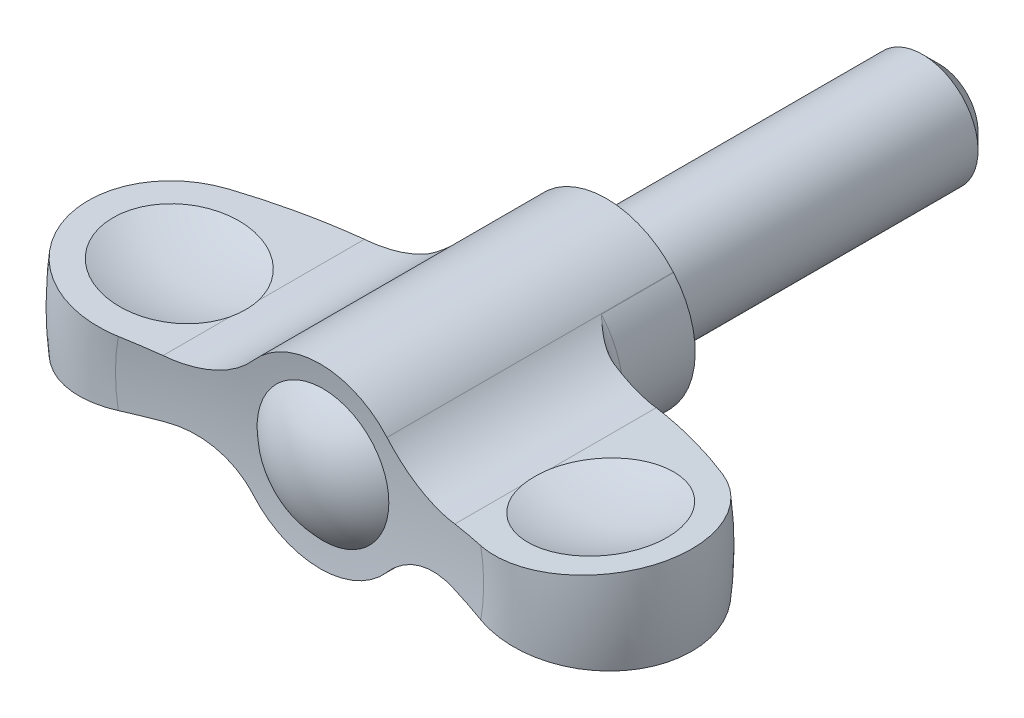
ISO-10303-21;
HEADER;
FILE_DESCRIPTION(('STEP AP214'),'2;1');
FILE_NAME('part.step','',(''),(''),'','','');
FILE_SCHEMA(('AUTOMOTIVE_DESIGN { 1 0 10303 214 1 1 1 1 }'));
ENDSEC;
DATA;
#1=APPLICATION_CONTEXT('core data for automotive mechanical design processes');
#2=APPLICATION_PROTOCOL_DEFINITION('international standard','automotive_design',2000,#1);
#3=PRODUCT_CONTEXT('',#1,'mechanical');
#4=PRODUCT('Part','Part','',(#3));
#5=PRODUCT_RELATED_PRODUCT_CATEGORY('part','',(#4));
#6=PRODUCT_DEFINITION_FORMATION('','',#4);
#7=PRODUCT_DEFINITION_CONTEXT('part definition',#1,'design');
#8=PRODUCT_DEFINITION('design','',#6,#7);
#9=PRODUCT_DEFINITION_SHAPE('','',#8);
#10=(LENGTH_UNIT() NAMED_UNIT(*) SI_UNIT(.MILLI.,.METRE.));
#11=(NAMED_UNIT(*) PLANE_ANGLE_UNIT() SI_UNIT($,.RADIAN.));
#12=(NAMED_UNIT(*) SI_UNIT($,.STERADIAN.) SOLID_ANGLE_UNIT());
#13=UNCERTAINTY_MEASURE_WITH_UNIT(LENGTH_MEASURE(1.E-05),#10,'distance_accuracy_value','');
#14=(GEOMETRIC_REPRESENTATION_CONTEXT(3) GLOBAL_UNCERTAINTY_ASSIGNED_CONTEXT((#13)) GLOBAL_UNIT_ASSIGNED_CONTEXT((#10,
#11,#12)) REPRESENTATION_CONTEXT('',''));
#15=CARTESIAN_POINT('',(0.,0.,0.));
#16=DIRECTION('',(0.,0.,1.));
#17=DIRECTION('',(1.,0.,0.));
#18=AXIS2_PLACEMENT_3D('',#15,#16,#17);
#19=CARTESIAN_POINT('',(0.,0.,6.5));
#20=DIRECTION('',(0.,0.,1.));
#21=DIRECTION('',(0.,-1.,0.));
#22=AXIS2_PLACEMENT_3D('',#19,#20,#21);
#23=TOROIDAL_SURFACE('',#22,9.4,1.40000000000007);
#24=DIRECTION('',(0.,0.,1.));
#25=VECTOR('',#24,1.);
#26=CARTESIAN_POINT('',(6.03890778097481,-5.2470556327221,-30.));
#27=LINE('',#26,#25);
#28=CARTESIAN_POINT('',(6.03890778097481,-5.24705563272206,6.5));
#29=VERTEX_POINT('',#28);
#30=CARTESIAN_POINT('',(6.03890778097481,-5.2470556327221,6.5021200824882));
#31=VERTEX_POINT('',#30);
#32=EDGE_CURVE('E178',#29,#31,#27,.T.);
#33=ORIENTED_EDGE('',*,*,#32,.F.);
#34=CARTESIAN_POINT('',(0.,0.,6.5));
#35=DIRECTION('',(0.,0.,1.));
#36=DIRECTION('',(0.,-1.,0.));
#37=AXIS2_PLACEMENT_3D('',#34,#35,#36);
#38=CIRCLE('',#37,8.);
#39=CARTESIAN_POINT('',(6.0470062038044,5.23772049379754,6.4999999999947));
#40=VERTEX_POINT('',#39);
#41=EDGE_CURVE('E299',#29,#40,#38,.T.);
#42=ORIENTED_EDGE('',*,*,#41,.T.);
#43=CARTESIAN_POINT('',(8.59708199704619,3.29504177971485,7.88661989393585));
#44=CARTESIAN_POINT('',(8.50944178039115,3.33729136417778,7.87729621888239));
#45=CARTESIAN_POINT('',(8.42307614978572,3.38091432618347,7.86348310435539));
#46=CARTESIAN_POINT('',(8.25334791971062,3.47048341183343,7.82827393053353));
#47=CARTESIAN_POINT('',(8.16997966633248,3.51642472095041,7.80689307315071));
#48=CARTESIAN_POINT('',(8.006927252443,3.6100455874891,7.75806975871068));
#49=CARTESIAN_POINT('',(7.92722117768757,3.65771052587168,7.73067131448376));
#50=CARTESIAN_POINT('',(7.77086822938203,3.75487699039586,7.67078020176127));
#51=CARTESIAN_POINT('',(7.69422278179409,3.80437935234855,7.6382851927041));
#52=CARTESIAN_POINT('',(7.51481068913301,3.9245724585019,7.55570149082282));
#53=CARTESIAN_POINT('',(7.41345025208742,3.996030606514,7.50367899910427));
#54=CARTESIAN_POINT('',(7.21620642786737,4.14190058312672,7.39355525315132));
#55=CARTESIAN_POINT('',(7.12032815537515,4.21631506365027,7.33544846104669));
#56=CARTESIAN_POINT('',(6.89765495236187,4.39723051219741,7.19147911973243));
#57=CARTESIAN_POINT('',(6.77323076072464,4.50501816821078,7.10356810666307));
#58=CARTESIAN_POINT('',(6.57394920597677,4.68848676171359,6.95337103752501));
#59=CARTESIAN_POINT('',(6.49659267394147,4.7626588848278,6.89250585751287));
#60=CARTESIAN_POINT('',(6.37240043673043,4.8865809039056,6.79132557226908));
#61=CARTESIAN_POINT('',(6.32451434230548,4.93561192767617,6.75141880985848));
#62=CARTESIAN_POINT('',(6.24744938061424,5.01656740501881,6.68590586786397));
#63=CARTESIAN_POINT('',(6.21784284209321,5.04817964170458,6.66041557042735));
#64=CARTESIAN_POINT('',(6.1701203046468,5.09997024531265,6.61881307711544));
#65=CARTESIAN_POINT('',(6.15183084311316,5.12002285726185,6.60274326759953));
#66=CARTESIAN_POINT('',(6.12231217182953,5.15271930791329,6.57655539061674));
#67=CARTESIAN_POINT('',(6.11100884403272,5.16531979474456,6.56646663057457));
#68=CARTESIAN_POINT('',(6.09275021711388,5.18580384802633,6.549990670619));
#69=CARTESIAN_POINT('',(6.08575717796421,5.19368060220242,6.54363714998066));
#70=CARTESIAN_POINT('',(6.07446460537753,5.20645064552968,6.53319636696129));
#71=CARTESIAN_POINT('',(6.07013806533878,5.21135545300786,6.52915239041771));
#72=CARTESIAN_POINT('',(6.06316395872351,5.21928103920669,6.52242537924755));
#73=CARTESIAN_POINT('',(6.06049083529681,5.22232358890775,6.51979601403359));
#74=CARTESIAN_POINT('',(6.05620285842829,5.22721145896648,6.51533355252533));
#75=CARTESIAN_POINT('',(6.05455913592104,5.22908696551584,6.51356171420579));
#76=CARTESIAN_POINT('',(6.05194270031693,5.23207504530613,6.51046552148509));
#77=CARTESIAN_POINT('',(6.05093886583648,5.23322217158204,6.50920550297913));
#78=CARTESIAN_POINT('',(6.04952852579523,5.23483466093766,6.50714224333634));
#79=CARTESIAN_POINT('',(6.04907130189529,5.23535757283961,6.50641962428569));
#80=CARTESIAN_POINT('',(6.04823146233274,5.23631829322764,6.50488003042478));
#81=CARTESIAN_POINT('',(6.04784824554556,5.23675678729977,6.50406390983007));
#82=CARTESIAN_POINT('',(6.04743475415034,5.2372299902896,6.50282878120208));
#83=CARTESIAN_POINT('',(6.04733123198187,5.23734847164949,6.50246832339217));
#84=CARTESIAN_POINT('',(6.04716301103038,5.23754100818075,6.50172769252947));
#85=CARTESIAN_POINT('',(6.04709815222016,5.23761524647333,6.50134760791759));
#86=CARTESIAN_POINT('',(6.04703697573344,5.23768527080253,6.50077037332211));
#87=CARTESIAN_POINT('',(6.04702259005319,5.23770173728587,6.50057747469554));
#88=CARTESIAN_POINT('',(6.0470060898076,5.23772062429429,6.50018965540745));
#89=CARTESIAN_POINT('',(6.04700402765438,5.23772298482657,6.49999472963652));
#90=CARTESIAN_POINT('',(6.0470084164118,5.23771796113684,6.49979999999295));
#91=B_SPLINE_CURVE_WITH_KNOTS('',3,(#43,#44,#45,#46,#47,#48,#49,#50,#51,#52,#53,#54,#55,#56,#57,
#58,#59,#60,#61,#62,#63,#64,#65,#66,#67,#68,#69,#70,#71,#72,#73,#74,#75,#76,#77,#78,#79,#80,#81,
#82,#83,#84,#85,#86,#87,#88,#89,#90),.UNSPECIFIED.,.F.,.F.,(4,2,2,2,2,2,2,2,2,2,2,2,2,2,2,2,2,2,
2,2,2,2,2,4),(0.,0.292919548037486,0.585253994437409,0.875517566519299,1.16591483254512,
1.56900991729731,1.97247513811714,2.53185645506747,2.90152662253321,3.1394263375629,
3.29018867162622,3.38481100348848,3.44392835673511,3.48083041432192,3.50389909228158,
3.51838177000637,3.52755772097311,3.53347737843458,3.53648190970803,3.53946090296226,
3.54063718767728,3.54180856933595,3.54239014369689,3.5429741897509),.UNSPECIFIED.);
#92=CARTESIAN_POINT('',(8.59520200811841,3.29594858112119,7.88641989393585));
#93=VERTEX_POINT('',#92);
#94=EDGE_CURVE('E445',#93,#40,#91,.T.);
#95=ORIENTED_EDGE('',*,*,#94,.F.);
#96=CARTESIAN_POINT('',(0.,0.,7.88641989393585));
#97=DIRECTION('',(0.,0.,1.));
#98=DIRECTION('',(0.,-1.,0.));
#99=AXIS2_PLACEMENT_3D('',#96,#97,#98);
#100=CIRCLE('',#99,9.20547525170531);
#101=CARTESIAN_POINT('',(8.59545916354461,-3.29527789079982,7.88641989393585));
#102=VERTEX_POINT('',#101);
#103=EDGE_CURVE('E300',#102,#93,#100,.T.);
#104=ORIENTED_EDGE('',*,*,#103,.F.);
#105=CARTESIAN_POINT('',(9.2464198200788,-3.01597169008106,7.86154869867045));
#106=CARTESIAN_POINT('',(9.191703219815,-3.03662617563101,7.87246212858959));
#107=CARTESIAN_POINT('',(9.13683292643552,-3.05803382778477,7.88088984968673));
#108=CARTESIAN_POINT('',(9.0272184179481,-3.10220967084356,7.89317258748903));
#109=CARTESIAN_POINT('',(8.97247413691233,-3.12497578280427,7.89703441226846));
#110=CARTESIAN_POINT('',(8.80995844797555,-3.19470660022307,7.90236716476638));
#111=CARTESIAN_POINT('',(8.70276195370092,-3.24353448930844,7.89779252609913));
#112=CARTESIAN_POINT('',(8.51047394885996,-3.33625869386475,7.87741400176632));
#113=CARTESIAN_POINT('',(8.42481297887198,-3.37951008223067,7.86372857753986));
#114=CARTESIAN_POINT('',(8.25627111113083,-3.46839491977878,7.82888132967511));
#115=CARTESIAN_POINT('',(8.17339149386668,-3.51402944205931,7.80771611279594));
#116=CARTESIAN_POINT('',(7.92832133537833,-3.65460006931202,7.73466741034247));
#117=CARTESIAN_POINT('',(7.77073045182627,-3.75270198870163,7.67337075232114));
#118=CARTESIAN_POINT('',(7.51219223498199,-3.92592329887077,7.55434149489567));
#119=CARTESIAN_POINT('',(7.40810830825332,-3.99942155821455,7.50076399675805));
#120=CARTESIAN_POINT('',(7.20573498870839,-4.14951628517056,7.38724676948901));
#121=CARTESIAN_POINT('',(7.10744753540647,-4.22611377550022,7.32730492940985));
#122=CARTESIAN_POINT('',(6.91648045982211,-4.38209339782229,7.20294133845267));
#123=CARTESIAN_POINT('',(6.82379096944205,-4.46147021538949,7.13852792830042));
#124=CARTESIAN_POINT('',(6.64338510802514,-4.62314447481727,7.00654560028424));
#125=CARTESIAN_POINT('',(6.55566785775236,-4.70544139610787,6.93897724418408));
#126=CARTESIAN_POINT('',(6.43300905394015,-4.82577735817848,6.84059313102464));
#127=CARTESIAN_POINT('',(6.39621820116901,-4.86258512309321,6.8105538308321));
#128=CARTESIAN_POINT('',(6.32347498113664,-4.93679114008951,6.75019039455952));
#129=CARTESIAN_POINT('',(6.28752259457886,-4.97418937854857,6.71986626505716));
#130=CARTESIAN_POINT('',(6.23420044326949,-5.03074553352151,6.67427938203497));
#131=CARTESIAN_POINT('',(6.21653276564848,-5.04966820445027,6.65907163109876));
#132=CARTESIAN_POINT('',(6.18141428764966,-5.08764734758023,6.62856921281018));
#133=CARTESIAN_POINT('',(6.16396349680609,-5.10670382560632,6.61327454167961));
#134=CARTESIAN_POINT('',(6.12918837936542,-5.14505447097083,6.58285648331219));
#135=CARTESIAN_POINT('',(6.11186402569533,-5.16434858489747,6.5677330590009));
#136=CARTESIAN_POINT('',(6.07769243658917,-5.20276831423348,6.53674407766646));
#137=CARTESIAN_POINT('',(6.06084502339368,-5.22189399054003,6.52087880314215));
#138=CARTESIAN_POINT('',(6.04125233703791,-5.24436286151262,6.50407138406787));
#139=CARTESIAN_POINT('',(6.03883132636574,-5.24714312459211,6.5020224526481));
#140=CARTESIAN_POINT('',(6.036402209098,-5.24993655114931,6.5));
#141=B_SPLINE_CURVE_WITH_KNOTS('',3,(#105,#106,#107,#108,#109,#110,#111,#112,#113,#114,#115,
#116,#117,#118,#119,#120,#121,#122,#123,#124,#125,#126,#127,#128,#129,#130,#131,#132,#133,#134,
#135,#136,#137,#138,#139,#140),.UNSPECIFIED.,.F.,.F.,(4,2,2,2,2,2,2,2,2,2,2,2,2,2,2,2,2,4),(0.,
0.178341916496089,0.356417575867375,0.708892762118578,0.999321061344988,1.28988128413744,
1.87442815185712,2.28884312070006,2.7033959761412,3.11719533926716,3.53092130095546,
3.71118323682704,3.89144102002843,3.98151493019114,4.07159278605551,4.16165075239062,
4.25167469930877,4.26432797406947),.UNSPECIFIED.);
#142=EDGE_CURVE('E316',#31,#102,#141,.F.);
#143=ORIENTED_EDGE('',*,*,#142,.F.);
#144=EDGE_LOOP('',(#33,#42,#95,#104,#143));
#145=FACE_BOUND('',#144,.T.);
#146=ADVANCED_FACE('F14',(#145),#23,.F.);
#147=CARTESIAN_POINT('',(7.9999999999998,0.,0.));
#148=DIRECTION('',(0.,0.,-1.));
#149=DIRECTION('',(0.,1.,0.));
#150=AXIS2_PLACEMENT_3D('',#147,#148,#149);
#151=PLANE('',#150);
#152=CARTESIAN_POINT('',(0.,0.,0.));
#153=DIRECTION('',(0.,0.,1.));
#154=DIRECTION('',(0.,-1.,0.));
#155=AXIS2_PLACEMENT_3D('',#152,#153,#154);
#156=CIRCLE('',#155,5.);
#157=CARTESIAN_POINT('',(0.,-5.,0.));
#158=VERTEX_POINT('',#157);
#159=EDGE_CURVE('E475',#158,#158,#156,.T.);
#160=ORIENTED_EDGE('',*,*,#159,.T.);
#161=EDGE_LOOP('',(#160));
#162=FACE_BOUND('',#161,.T.);
#163=CARTESIAN_POINT('',(12.0717114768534,10.5010774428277,0.));
#164=DIRECTION('',(0.,0.,-1.));
#165=DIRECTION('',(0.,1.,0.));
#166=AXIS2_PLACEMENT_3D('',#163,#164,#165);
#167=CIRCLE('',#166,8.);
#168=CARTESIAN_POINT('',(6.0470062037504,5.23772049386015,0.));
#169=VERTEX_POINT('',#168);
#170=CARTESIAN_POINT('',(6.02470527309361,5.26335694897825,0.));
#171=VERTEX_POINT('',#170);
#172=EDGE_CURVE('E454',#169,#171,#167,.T.);
#173=ORIENTED_EDGE('',*,*,#172,.F.);
#174=CARTESIAN_POINT('',(0.,0.,0.));
#175=DIRECTION('',(0.,0.,1.));
#176=DIRECTION('',(0.,-1.,0.));
#177=AXIS2_PLACEMENT_3D('',#174,#175,#176);
#178=CIRCLE('',#177,8.);
#179=CARTESIAN_POINT('',(-6.04700620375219,5.23772049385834,0.));
#180=VERTEX_POINT('',#179);
#181=EDGE_CURVE('E472',#180,#169,#178,.T.);
#182=ORIENTED_EDGE('',*,*,#181,.F.);
#183=CARTESIAN_POINT('',(-12.0717114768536,10.5010774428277,0.));
#184=DIRECTION('',(0.,0.,-1.));
#185=DIRECTION('',(0.,1.,0.));
#186=AXIS2_PLACEMENT_3D('',#183,#184,#185);
#187=CIRCLE('',#186,8.);
#188=CARTESIAN_POINT('',(-6.0247052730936,5.26335694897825,0.));
#189=VERTEX_POINT('',#188);
#190=EDGE_CURVE('E521',#180,#189,#187,.F.);
#191=ORIENTED_EDGE('',*,*,#190,.T.);
#192=EDGE_CURVE('E471',#171,#189,#178,.T.);
#193=ORIENTED_EDGE('',*,*,#192,.F.);
#194=EDGE_LOOP('',(#173,#182,#191,#193));
#195=FACE_BOUND('',#194,.T.);
#196=ADVANCED_FACE('F268',(#162,#195),#151,.T.);
#197=CARTESIAN_POINT('',(0.,0.,32.9780362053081));
#198=DIRECTION('',(0.,0.,1.));
#199=DIRECTION('',(0.,-1.,0.));
#200=AXIS2_PLACEMENT_3D('',#197,#198,#199);
#201=CYLINDRICAL_SURFACE('',#200,8.);
#202=DIRECTION('',(0.,0.,1.));
#203=VECTOR('',#202,1.);
#204=CARTESIAN_POINT('',(-6.0247052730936,5.26335694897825,-30.));
#205=LINE('',#204,#203);
#206=CARTESIAN_POINT('',(-6.0247052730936,5.26335694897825,25.8131362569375));
#207=VERTEX_POINT('',#206);
#208=EDGE_CURVE('E162',#189,#207,#205,.T.);
#209=ORIENTED_EDGE('',*,*,#208,.T.);
#210=CARTESIAN_POINT('',(0.,0.,25.8131362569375));
#211=DIRECTION('',(0.,0.,1.));
#212=DIRECTION('',(0.,-1.,0.));
#213=AXIS2_PLACEMENT_3D('',#210,#211,#212);
#214=CIRCLE('',#213,8.);
#215=CARTESIAN_POINT('',(6.02470527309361,5.26335694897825,25.8131362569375));
#216=VERTEX_POINT('',#215);
#217=EDGE_CURVE('E477',#216,#207,#214,.T.);
#218=ORIENTED_EDGE('',*,*,#217,.F.);
#219=DIRECTION('',(0.,0.,1.));
#220=VECTOR('',#219,1.);
#221=CARTESIAN_POINT('',(6.02470527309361,5.26335694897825,-30.));
#222=LINE('',#221,#220);
#223=EDGE_CURVE('E165',#171,#216,#222,.T.);
#224=ORIENTED_EDGE('',*,*,#223,.F.);
#225=ORIENTED_EDGE('',*,*,#192,.T.);
#226=EDGE_LOOP('',(#209,#218,#224,#225));
#227=FACE_BOUND('',#226,.T.);
#228=ADVANCED_FACE('F275',(#227),#201,.T.);
#229=DIRECTION('',(0.,0.,1.));
#230=VECTOR('',#229,1.);
#231=CARTESIAN_POINT('',(-6.04700620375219,5.23772049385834,3.25));
#232=LINE('',#231,#230);
#233=CARTESIAN_POINT('',(-6.04700620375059,5.23772049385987,6.5));
#234=VERTEX_POINT('',#233);
#235=EDGE_CURVE('E523',#180,#234,#232,.T.);
#236=ORIENTED_EDGE('',*,*,#235,.F.);
#237=ORIENTED_EDGE('',*,*,#181,.T.);
#238=DIRECTION('',(0.,0.,1.));
#239=VECTOR('',#238,1.);
#240=CARTESIAN_POINT('',(6.0470062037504,5.23772049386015,3.25));
#241=LINE('',#240,#239);
#242=EDGE_CURVE('E451',#169,#40,#241,.T.);
#243=ORIENTED_EDGE('',*,*,#242,.T.);
#244=ORIENTED_EDGE('',*,*,#41,.F.);
#245=ORIENTED_EDGE('',*,*,#32,.T.);
#246=CARTESIAN_POINT('',(6.03890778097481,-5.2470556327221,25.8131362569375));
#247=VERTEX_POINT('',#246);
#248=EDGE_CURVE('E175',#31,#247,#27,.T.);
#249=ORIENTED_EDGE('',*,*,#248,.T.);
#250=CARTESIAN_POINT('',(0.,0.,25.8131362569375));
#251=DIRECTION('',(0.,0.,1.));
#252=DIRECTION('',(0.,-1.,0.));
#253=AXIS2_PLACEMENT_3D('',#250,#251,#252);
#254=CIRCLE('',#253,8.);
#255=CARTESIAN_POINT('',(-6.0389077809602,-5.24705563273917,25.8131362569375));
#256=VERTEX_POINT('',#255);
#257=EDGE_CURVE('E304',#256,#247,#254,.T.);
#258=ORIENTED_EDGE('',*,*,#257,.F.);
#259=DIRECTION('',(0.,0.,1.));
#260=VECTOR('',#259,1.);
#261=CARTESIAN_POINT('',(-6.03890778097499,-5.2470556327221,-30.));
#262=LINE('',#261,#260);
#263=CARTESIAN_POINT('',(-6.03890778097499,-5.2470556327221,6.5021200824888));
#264=VERTEX_POINT('',#263);
#265=EDGE_CURVE('E171',#264,#256,#262,.T.);
#266=ORIENTED_EDGE('',*,*,#265,.F.);
#267=CARTESIAN_POINT('',(-6.03890778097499,-5.24705563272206,6.5));
#268=VERTEX_POINT('',#267);
#269=EDGE_CURVE('E174',#268,#264,#262,.T.);
#270=ORIENTED_EDGE('',*,*,#269,.F.);
#271=EDGE_CURVE('E294',#234,#268,#38,.T.);
#272=ORIENTED_EDGE('',*,*,#271,.F.);
#273=EDGE_LOOP('',(#236,#237,#243,#244,#245,#249,#258,#266,#270,#272));
#274=FACE_BOUND('',#273,.T.);
#275=ADVANCED_FACE('F282',(#274),#201,.T.);
#276=ORIENTED_EDGE('',*,*,#271,.T.);
#277=ORIENTED_EDGE('',*,*,#269,.T.);
#278=CARTESIAN_POINT('',(-9.246419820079,-3.01597169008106,7.86154869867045));
#279=CARTESIAN_POINT('',(-9.19170321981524,-3.03662617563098,7.87246212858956));
#280=CARTESIAN_POINT('',(-9.1368329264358,-3.05803382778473,7.88088984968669));
#281=CARTESIAN_POINT('',(-9.02721841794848,-3.10220967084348,7.89317258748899));
#282=CARTESIAN_POINT('',(-8.97247413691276,-3.12497578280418,7.89703441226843));
#283=CARTESIAN_POINT('',(-8.80995844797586,-3.19470660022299,7.9023671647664));
#284=CARTESIAN_POINT('',(-8.70276195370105,-3.24353448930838,7.89779252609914));
#285=CARTESIAN_POINT('',(-8.51047394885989,-3.33625869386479,7.87741400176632));
#286=CARTESIAN_POINT('',(-8.42481297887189,-3.37951008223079,7.86372857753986));
#287=CARTESIAN_POINT('',(-8.25627111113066,-3.46839491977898,7.82888132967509));
#288=CARTESIAN_POINT('',(-8.17339149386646,-3.51402944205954,7.80771611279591));
#289=CARTESIAN_POINT('',(-7.92832133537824,-3.65460006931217,7.73466741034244));
#290=CARTESIAN_POINT('',(-7.77073045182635,-3.75270198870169,7.67337075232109));
#291=CARTESIAN_POINT('',(-7.51219223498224,-3.92592329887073,7.55434149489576));
#292=CARTESIAN_POINT('',(-7.40810830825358,-3.99942155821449,7.50076399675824));
#293=CARTESIAN_POINT('',(-7.20573498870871,-4.14951628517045,7.38724676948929));
#294=CARTESIAN_POINT('',(-7.10744753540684,-4.22611377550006,7.32730492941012));
#295=CARTESIAN_POINT('',(-6.91648045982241,-4.38209339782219,7.20294133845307));
#296=CARTESIAN_POINT('',(-6.82379096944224,-4.46147021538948,7.13852792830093));
#297=CARTESIAN_POINT('',(-6.64338510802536,-4.62314447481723,7.00654560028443));
#298=CARTESIAN_POINT('',(-6.5556678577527,-4.7054413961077,6.93897724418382));
#299=CARTESIAN_POINT('',(-6.43300905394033,-4.82577735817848,6.84059313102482));
#300=CARTESIAN_POINT('',(-6.39621820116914,-4.86258512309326,6.81055383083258));
#301=CARTESIAN_POINT('',(-6.3234749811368,-4.93679114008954,6.75019039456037));
#302=CARTESIAN_POINT('',(-6.28752259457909,-4.97418937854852,6.71986626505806));
#303=CARTESIAN_POINT('',(-6.23420044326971,-5.03074553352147,6.6742793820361));
#304=CARTESIAN_POINT('',(-6.21653276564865,-5.04966820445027,6.65907163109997));
#305=CARTESIAN_POINT('',(-6.18141428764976,-5.08764734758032,6.62856921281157));
#306=CARTESIAN_POINT('',(-6.16396349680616,-5.10670382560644,6.61327454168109));
#307=CARTESIAN_POINT('',(-6.12918837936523,-5.14505447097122,6.58285648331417));
#308=CARTESIAN_POINT('',(-6.11186402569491,-5.1643485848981,6.56773305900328));
#309=CARTESIAN_POINT('',(-6.07769243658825,-5.20276831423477,6.53674407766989));
#310=CARTESIAN_POINT('',(-6.06084502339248,-5.22189399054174,6.52087880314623));
#311=CARTESIAN_POINT('',(-6.04125233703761,-5.24436286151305,6.50407138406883));
#312=CARTESIAN_POINT('',(-6.03883132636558,-5.24714312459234,6.50202245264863));
#313=CARTESIAN_POINT('',(-6.036402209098,-5.2499365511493,6.5));
#314=B_SPLINE_CURVE_WITH_KNOTS('',3,(#278,#279,#280,#281,#282,#283,#284,#285,#286,#287,#288,
#289,#290,#291,#292,#293,#294,#295,#296,#297,#298,#299,#300,#301,#302,#303,#304,#305,#306,#307,
#308,#309,#310,#311,#312,#313),.UNSPECIFIED.,.F.,.F.,(4,2,2,2,2,2,2,2,2,2,2,2,2,2,2,2,2,4),(0.,
0.178341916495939,0.356417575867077,0.708892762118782,0.999321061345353,1.28988128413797,
1.8744281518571,2.28884312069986,2.70339597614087,3.11719533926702,3.53092130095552,
3.71118323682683,3.89144102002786,3.98151493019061,4.07159278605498,4.16165075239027,
4.25167469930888,4.2643279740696),.UNSPECIFIED.);
#315=CARTESIAN_POINT('',(-8.59545916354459,-3.29527789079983,7.88641989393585));
#316=VERTEX_POINT('',#315);
#317=EDGE_CURVE('E311',#264,#316,#314,.F.);
#318=ORIENTED_EDGE('',*,*,#317,.T.);
#319=CARTESIAN_POINT('',(-8.5952020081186,3.29594858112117,7.88641989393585));
#320=VERTEX_POINT('',#319);
#321=EDGE_CURVE('E467',#320,#316,#100,.T.);
#322=ORIENTED_EDGE('',*,*,#321,.F.);
#323=CARTESIAN_POINT('',(-8.59708199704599,3.29504177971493,7.88661989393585));
#324=CARTESIAN_POINT('',(-8.50944178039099,3.33729136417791,7.87729621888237));
#325=CARTESIAN_POINT('',(-8.42307614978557,3.38091432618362,7.86348310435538));
#326=CARTESIAN_POINT('',(-8.25334791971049,3.47048341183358,7.82827393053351));
#327=CARTESIAN_POINT('',(-8.16997966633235,3.51642472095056,7.80689307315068));
#328=CARTESIAN_POINT('',(-8.00692725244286,3.61004558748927,7.75806975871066));
#329=CARTESIAN_POINT('',(-7.92722117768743,3.65771052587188,7.73067131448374));
#330=CARTESIAN_POINT('',(-7.77086822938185,3.75487699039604,7.67078020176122));
#331=CARTESIAN_POINT('',(-7.69422278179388,3.80437935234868,7.63828519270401));
#332=CARTESIAN_POINT('',(-7.51481068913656,3.92457245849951,7.55570149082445));
#333=CARTESIAN_POINT('',(-7.41345025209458,3.99603060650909,7.50367899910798));
#334=CARTESIAN_POINT('',(-7.21620642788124,4.14190058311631,7.39355525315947));
#335=CARTESIAN_POINT('',(-7.12032815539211,4.2163150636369,7.33544846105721));
#336=CARTESIAN_POINT('',(-6.8976549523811,4.39723051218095,7.19147911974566));
#337=CARTESIAN_POINT('',(-6.77323076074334,4.50501816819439,7.1035681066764));
#338=CARTESIAN_POINT('',(-6.57394920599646,4.68848676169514,6.95337103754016));
#339=CARTESIAN_POINT('',(-6.49659267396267,4.76265888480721,6.89250585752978));
#340=CARTESIAN_POINT('',(-6.37240043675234,4.88658090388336,6.7913255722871));
#341=CARTESIAN_POINT('',(-6.32451434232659,4.93561192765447,6.7514188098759));
#342=CARTESIAN_POINT('',(-6.24744938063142,5.01656740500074,6.68590586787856));
#343=CARTESIAN_POINT('',(-6.21784284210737,5.04817964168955,6.66041557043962));
#344=CARTESIAN_POINT('',(-6.17012030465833,5.09997024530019,6.61881307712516));
#345=CARTESIAN_POINT('',(-6.1518308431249,5.12002285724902,6.60274326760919));
#346=CARTESIAN_POINT('',(-6.12231217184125,5.15271930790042,6.57655539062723));
#347=CARTESIAN_POINT('',(-6.11100884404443,5.16531979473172,6.56646663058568));
#348=CARTESIAN_POINT('',(-6.09275021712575,5.1858038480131,6.54999067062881));
#349=CARTESIAN_POINT('',(-6.08575717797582,5.19368060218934,6.54363714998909));
#350=CARTESIAN_POINT('',(-6.07446460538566,5.20645064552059,6.53319636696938));
#351=CARTESIAN_POINT('',(-6.07013806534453,5.21135545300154,6.52915239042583));
#352=CARTESIAN_POINT('',(-6.06316395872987,5.21928103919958,6.52242537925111));
#353=CARTESIAN_POINT('',(-6.06049083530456,5.22232358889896,6.51979601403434));
#354=CARTESIAN_POINT('',(-6.05620285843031,5.22721145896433,6.51533355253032));
#355=CARTESIAN_POINT('',(-6.05455913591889,5.22908696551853,6.51356171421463));
#356=CARTESIAN_POINT('',(-6.05194270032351,5.23207504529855,6.51046552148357));
#357=CARTESIAN_POINT('',(-6.05093886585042,5.23322217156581,6.50920550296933));
#358=CARTESIAN_POINT('',(-6.04952852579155,5.23483466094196,6.5071422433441));
#359=CARTESIAN_POINT('',(-6.0490713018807,5.23535757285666,6.50641962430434));
#360=CARTESIAN_POINT('',(-6.04823146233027,5.23631829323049,6.50488003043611));
#361=CARTESIAN_POINT('',(-6.04784824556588,5.23675678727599,6.50406390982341));
#362=CARTESIAN_POINT('',(-6.04743475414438,5.23722999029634,6.50282878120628));
#363=CARTESIAN_POINT('',(-6.04733123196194,5.23734847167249,6.50246832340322));
#364=CARTESIAN_POINT('',(-6.04716301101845,5.23754100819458,6.50172769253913));
#365=CARTESIAN_POINT('',(-6.04709815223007,5.23761524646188,6.50134760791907));
#366=CARTESIAN_POINT('',(-6.04703697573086,5.23768527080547,6.5007703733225));
#367=CARTESIAN_POINT('',(-6.04702259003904,5.23770173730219,6.50057747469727));
#368=CARTESIAN_POINT('',(-6.04700608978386,5.23772062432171,6.50018965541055));
#369=CARTESIAN_POINT('',(-6.04700402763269,5.23772298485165,6.49999472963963));
#370=CARTESIAN_POINT('',(-6.0470084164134,5.23771796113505,6.49979999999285));
#371=B_SPLINE_CURVE_WITH_KNOTS('',3,(#323,#324,#325,#326,#327,#328,#329,#330,#331,#332,#333,
#334,#335,#336,#337,#338,#339,#340,#341,#342,#343,#344,#345,#346,#347,#348,#349,#350,#351,#352,
#353,#354,#355,#356,#357,#358,#359,#360,#361,#362,#363,#364,#365,#366,#367,#368,#369,#370),
.UNSPECIFIED.,.F.,.F.,(4,2,2,2,2,2,2,2,2,2,2,2,2,2,2,2,2,2,2,2,2,2,2,4),(0.,0.292919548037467,
0.58525399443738,0.875517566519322,1.16591483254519,1.56900991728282,1.97247513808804,
2.53185645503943,2.90152662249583,3.13942633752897,3.29018867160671,3.38481100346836,
3.44392835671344,3.48083041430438,3.503899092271,3.51838176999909,3.52755772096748,
3.53347737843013,3.53648190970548,3.53946090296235,3.54063718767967,3.54180856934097,
3.54239014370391,3.54297418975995),.UNSPECIFIED.);
#372=EDGE_CURVE('E194',#320,#234,#371,.T.);
#373=ORIENTED_EDGE('',*,*,#372,.T.);
#374=EDGE_LOOP('',(#276,#277,#318,#322,#373));
#375=FACE_BOUND('',#374,.T.);
#376=ADVANCED_FACE('F270',(#375),#23,.F.);
#377=CARTESIAN_POINT('',(0.,0.,55.408674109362));
#378=DIRECTION('',(0.,0.,1.));
#379=DIRECTION('',(0.,-1.,0.));
#380=AXIS2_PLACEMENT_3D('',#377,#378,#379);
#381=DEGENERATE_TOROIDAL_SURFACE('',#380,2.53775894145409,47.9877389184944,.T.);
#382=ORIENTED_EDGE('',*,*,#103,.T.);
#383=CARTESIAN_POINT('',(5.40789714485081,6.07461400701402,7.74825077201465));
#384=CARTESIAN_POINT('',(5.5291773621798,5.89198502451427,7.7417150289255));
#385=CARTESIAN_POINT('',(5.65803975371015,5.71432205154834,7.7372582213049));
#386=CARTESIAN_POINT('',(5.92992964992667,5.37014226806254,7.7324895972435));
#387=CARTESIAN_POINT('',(6.07295642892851,5.2036248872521,7.73217756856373));
#388=CARTESIAN_POINT('',(6.37210580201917,4.88302009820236,7.73568398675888));
#389=CARTESIAN_POINT('',(6.52822111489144,4.72892587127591,7.73950015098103));
#390=CARTESIAN_POINT('',(6.85248447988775,4.43414479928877,7.75130368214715));
#391=CARTESIAN_POINT('',(7.02063240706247,4.29345781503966,7.75929100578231));
#392=CARTESIAN_POINT('',(7.36839276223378,4.02596374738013,7.77954568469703));
#393=CARTESIAN_POINT('',(7.54804576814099,3.89921061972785,7.79182895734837));
#394=CARTESIAN_POINT('',(7.9169239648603,3.66105266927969,7.82074605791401));
#395=CARTESIAN_POINT('',(8.10614934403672,3.54964814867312,7.83737997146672));
#396=CARTESIAN_POINT('',(8.49266533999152,3.34297499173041,7.87504105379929));
#397=CARTESIAN_POINT('',(8.68995161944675,3.24769781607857,7.89606588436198));
#398=CARTESIAN_POINT('',(9.09122637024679,3.07379499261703,7.94252339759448));
#399=CARTESIAN_POINT('',(9.29521479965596,2.99516924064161,7.96795605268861));
#400=CARTESIAN_POINT('',(9.70845663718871,2.854990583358,8.02319155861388));
#401=CARTESIAN_POINT('',(9.91771139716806,2.79344211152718,8.05299554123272));
#402=CARTESIAN_POINT('',(10.3400150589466,2.68771529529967,8.11688005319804));
#403=CARTESIAN_POINT('',(10.5530655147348,2.64354424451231,8.15096237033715));
#404=CARTESIAN_POINT('',(10.9815499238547,2.57272696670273,8.22326754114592));
#405=CARTESIAN_POINT('',(11.1969857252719,2.54609545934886,8.2614938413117));
#406=CARTESIAN_POINT('',(11.6284903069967,2.51043256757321,8.34184151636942));
#407=CARTESIAN_POINT('',(11.844558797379,2.50139409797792,8.38396131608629));
#408=CARTESIAN_POINT('',(12.2806577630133,2.50077046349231,8.47281848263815));
#409=CARTESIAN_POINT('',(12.5006723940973,2.50956853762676,8.51963625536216));
#410=CARTESIAN_POINT('',(12.9384709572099,2.54513800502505,8.6167995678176));
#411=CARTESIAN_POINT('',(13.156254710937,2.57191082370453,8.66714538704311));
#412=CARTESIAN_POINT('',(13.5879515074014,2.6430363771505,8.77098851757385));
#413=CARTESIAN_POINT('',(13.8018678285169,2.68737341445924,8.82448297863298));
#414=CARTESIAN_POINT('',(14.2246542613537,2.79313397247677,8.93430204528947));
#415=CARTESIAN_POINT('',(14.4335251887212,2.85455471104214,8.99062618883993));
#416=CARTESIAN_POINT('',(14.6392212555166,2.92427775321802,9.04819298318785));
#417=B_SPLINE_CURVE_WITH_KNOTS('',3,(#383,#384,#385,#386,#387,#388,#389,#390,#391,#392,#393,
#394,#395,#396,#397,#398,#399,#400,#401,#402,#403,#404,#405,#406,#407,#408,#409,#410,#411,#412,
#413,#414,#415,#416),.UNSPECIFIED.,.F.,.F.,(4,2,2,2,2,2,2,2,2,2,2,2,2,2,2,2,4),(0.,
0.657784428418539,1.31553517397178,1.9729224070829,2.63030281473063,3.2901452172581,
3.95000060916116,4.60950551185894,5.26900628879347,5.92867812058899,6.58862653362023,
7.24912809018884,7.90936359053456,8.58393530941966,9.25856052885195,9.93258417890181,
10.6064981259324),.UNSPECIFIED.);
#418=CARTESIAN_POINT('',(13.1528156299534,2.57446317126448,8.66701618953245));
#419=VERTEX_POINT('',#418);
#420=EDGE_CURVE('E438',#93,#419,#417,.T.);
#421=ORIENTED_EDGE('',*,*,#420,.T.);
#422=CARTESIAN_POINT('',(13.1526156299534,2.57444288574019,8.66696966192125));
#423=CARTESIAN_POINT('',(13.9370340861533,2.65400458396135,8.84943351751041));
#424=CARTESIAN_POINT('',(14.7168563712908,2.73310010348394,9.05185397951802));
#425=CARTESIAN_POINT('',(16.2633623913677,2.88995853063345,9.49546553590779));
#426=CARTESIAN_POINT('',(17.0300745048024,2.96772431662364,9.73655668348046));
#427=CARTESIAN_POINT('',(18.5504261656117,3.12192996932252,10.2573018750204));
#428=CARTESIAN_POINT('',(19.3040656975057,3.19836983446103,10.5369559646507));
#429=CARTESIAN_POINT('',(20.7982632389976,3.34992273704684,11.134858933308));
#430=CARTESIAN_POINT('',(21.5387829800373,3.4250318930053,11.4532044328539));
#431=CARTESIAN_POINT('',(22.2708092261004,3.49927957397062,11.7901956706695));
#432=B_SPLINE_CURVE_WITH_KNOTS('',3,(#422,#423,#424,#425,#426,#427,#428,#429,#430,#431),
.UNSPECIFIED.,.F.,.F.,(4,2,2,2,4),(0.,2.42758220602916,4.84898838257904,7.27039742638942,
9.69798251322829),.UNSPECIFIED.);
#433=CARTESIAN_POINT('',(22.2703747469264,3.49923550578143,11.7899956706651));
#434=VERTEX_POINT('',#433);
#435=EDGE_CURVE('E431',#419,#434,#432,.T.);
#436=ORIENTED_EDGE('',*,*,#435,.T.);
#437=CARTESIAN_POINT('',(0.,0.,11.7899956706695));
#438=DIRECTION('',(0.,0.,1.));
#439=DIRECTION('',(0.,-1.,0.));
#440=AXIS2_PLACEMENT_3D('',#437,#438,#439);
#441=CIRCLE('',#440,22.5436075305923);
#442=CARTESIAN_POINT('',(22.2706216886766,-3.49766351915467,11.7899956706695));
#443=VERTEX_POINT('',#442);
#444=EDGE_CURVE('E464',#443,#434,#441,.T.);
#445=ORIENTED_EDGE('',*,*,#444,.F.);
#446=CARTESIAN_POINT('',(12.9962083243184,-2.55398166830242,8.63065853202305));
#447=CARTESIAN_POINT('',(13.7943446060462,-2.63519292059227,8.81347846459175));
#448=CARTESIAN_POINT('',(14.5877985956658,-2.71592774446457,9.01694513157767));
#449=CARTESIAN_POINT('',(16.1611919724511,-2.87602226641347,9.46398142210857));
#450=CARTESIAN_POINT('',(16.9411614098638,-2.95538502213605,9.70744418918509));
#451=CARTESIAN_POINT('',(18.4876557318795,-3.11274253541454,10.2342505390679));
#452=CARTESIAN_POINT('',(19.2541805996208,-3.19073729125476,10.5175941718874));
#453=CARTESIAN_POINT('',(20.7737763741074,-3.34535784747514,11.1241962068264));
#454=CARTESIAN_POINT('',(21.5268064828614,-3.42197949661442,11.4475578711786));
#455=CARTESIAN_POINT('',(22.271056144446,-3.4977077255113,11.7901956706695));
#456=B_SPLINE_CURVE_WITH_KNOTS('',3,(#446,#447,#448,#449,#450,#451,#452,#453,#454,#455),
.UNSPECIFIED.,.F.,.F.,(4,2,2,2,4),(0.,2.46819948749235,4.92990890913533,7.3916214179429,
9.85982400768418),.UNSPECIFIED.);
#457=CARTESIAN_POINT('',(12.9964083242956,-2.5540020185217,8.63070434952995));
#458=VERTEX_POINT('',#457);
#459=EDGE_CURVE('E414',#458,#443,#456,.T.);
#460=ORIENTED_EDGE('',*,*,#459,.F.);
#461=CARTESIAN_POINT('',(5.40816196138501,-6.0746786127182,7.7482771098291));
#462=CARTESIAN_POINT('',(5.52938177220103,-5.89205626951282,7.74173743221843));
#463=CARTESIAN_POINT('',(5.65818351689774,-5.7143974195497,7.73727619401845));
#464=CARTESIAN_POINT('',(5.92995209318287,-5.37022086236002,7.73249766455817));
#465=CARTESIAN_POINT('',(6.07291819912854,-5.20370258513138,7.7321801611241));
#466=CARTESIAN_POINT('',(6.37194671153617,-4.88309096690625,7.73567453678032));
#467=CARTESIAN_POINT('',(6.52800183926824,-4.72899081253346,7.73948413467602));
#468=CARTESIAN_POINT('',(6.85214571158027,-4.43419295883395,7.75127335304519));
#469=CARTESIAN_POINT('',(7.02023433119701,-4.29349512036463,7.75925293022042));
#470=CARTESIAN_POINT('',(7.36787685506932,-4.02597472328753,7.77949081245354));
#471=CARTESIAN_POINT('',(7.54747132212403,-3.89920607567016,7.79176502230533));
#472=CARTESIAN_POINT('',(7.91623418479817,-3.66101233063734,7.82066267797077));
#473=CARTESIAN_POINT('',(8.10540276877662,-3.54958753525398,7.83728620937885));
#474=CARTESIAN_POINT('',(8.49180737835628,-3.34286928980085,7.87492522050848));
#475=CARTESIAN_POINT('',(8.68903906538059,-3.24756730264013,7.89593836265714));
#476=CARTESIAN_POINT('',(9.09020720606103,-3.0736105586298,7.94237123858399));
#477=CARTESIAN_POINT('',(9.29414361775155,-2.99495569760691,7.96779094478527));
#478=CARTESIAN_POINT('',(9.70728411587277,-2.85471488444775,8.02299934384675));
#479=CARTESIAN_POINT('',(9.91648954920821,-2.79313334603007,8.05278916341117));
#480=CARTESIAN_POINT('',(10.3386977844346,-2.68733665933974,8.11664426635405));
#481=CARTESIAN_POINT('',(10.5517021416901,-2.6431288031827,8.15071133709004));
#482=CARTESIAN_POINT('',(10.980097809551,-2.57223450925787,8.22298504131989));
#483=CARTESIAN_POINT('',(11.1954909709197,-2.5455627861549,8.26119511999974));
#484=CARTESIAN_POINT('',(11.6269140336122,-2.50981645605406,8.34150952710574));
#485=CARTESIAN_POINT('',(11.8429436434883,-2.5007347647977,8.38361228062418));
#486=CARTESIAN_POINT('',(12.2789655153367,-2.50002106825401,8.4724337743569));
#487=CARTESIAN_POINT('',(12.4989420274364,-2.50877204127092,8.51923286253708));
#488=CARTESIAN_POINT('',(12.9366686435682,-2.5442445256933,8.61635812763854));
#489=CARTESIAN_POINT('',(13.1544185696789,-2.57096746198,8.66668458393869));
#490=CARTESIAN_POINT('',(13.5860522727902,-2.6419909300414,8.77048849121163));
#491=CARTESIAN_POINT('',(13.7999393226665,-2.68627577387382,8.82396309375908));
#492=CARTESIAN_POINT('',(14.2226717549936,-2.79192997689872,8.93374204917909));
#493=CARTESIAN_POINT('',(14.4315179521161,-2.85329655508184,8.99004594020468));
#494=CARTESIAN_POINT('',(14.6371915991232,-2.92296463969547,9.04759234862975));
#495=B_SPLINE_CURVE_WITH_KNOTS('',3,(#461,#462,#463,#464,#465,#466,#467,#468,#469,#470,#471,
#472,#473,#474,#475,#476,#477,#478,#479,#480,#481,#482,#483,#484,#485,#486,#487,#488,#489,#490,
#491,#492,#493,#494),.UNSPECIFIED.,.F.,.F.,(4,2,2,2,2,2,2,2,2,2,2,2,2,2,2,2,4),(0.,
0.657668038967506,1.31530240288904,1.97257345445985,2.62983768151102,3.28956225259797,
3.9492998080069,4.60868692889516,5.26806992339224,5.92762322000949,6.58745305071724,
7.24783584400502,7.90795261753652,8.58239553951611,9.25689194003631,9.93078716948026,
10.6045727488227),.UNSPECIFIED.);
#496=EDGE_CURVE('E314',#458,#102,#495,.F.);
#497=ORIENTED_EDGE('',*,*,#496,.T.);
#498=EDGE_LOOP('',(#382,#421,#436,#445,#460,#497));
#499=FACE_BOUND('',#498,.T.);
#500=ADVANCED_FACE('F281',(#499),#381,.T.);
#501=CARTESIAN_POINT('',(0.,0.,19.5161101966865));
#502=DIRECTION('',(0.,0.,1.));
#503=DIRECTION('',(0.,-1.,0.));
#504=AXIS2_PLACEMENT_3D('',#501,#502,#503);
#505=TOROIDAL_SURFACE('',#504,19.,8.5);
#506=CARTESIAN_POINT('',(0.,0.,27.6698599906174));
#507=DIRECTION('',(0.,0.,1.));
#508=DIRECTION('',(0.,-1.,0.));
#509=AXIS2_PLACEMENT_3D('',#506,#507,#508);
#510=CIRCLE('',#509,16.5986744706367);
#511=CARTESIAN_POINT('',(16.3443249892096,-2.89465625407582,27.6698599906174));
#512=VERTEX_POINT('',#511);
#513=CARTESIAN_POINT('',(16.3437132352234,2.89810832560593,27.6698599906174));
#514=VERTEX_POINT('',#513);
#515=EDGE_CURVE('E460',#512,#514,#510,.T.);
#516=ORIENTED_EDGE('',*,*,#515,.F.);
#517=CARTESIAN_POINT('',(22.2701871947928,-3.49761930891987,11.7897956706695));
#518=CARTESIAN_POINT('',(22.4865890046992,-3.51963843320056,11.8893708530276));
#519=CARTESIAN_POINT('',(22.6987916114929,-3.54123028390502,11.9981566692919));
#520=CARTESIAN_POINT('',(23.1133331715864,-3.5834103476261,12.2332797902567));
#521=CARTESIAN_POINT('',(23.3156725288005,-3.60399860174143,12.359616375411));
#522=CARTESIAN_POINT('',(23.7089103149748,-3.64401098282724,12.6288905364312));
#523=CARTESIAN_POINT('',(23.8998162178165,-3.66343587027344,12.771817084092));
#524=CARTESIAN_POINT('',(24.2689734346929,-3.70099802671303,13.0733193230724));
#525=CARTESIAN_POINT('',(24.4472249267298,-3.71913531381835,13.2318947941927));
#526=CARTESIAN_POINT('',(24.7898897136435,-3.75400183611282,13.5636589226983));
#527=CARTESIAN_POINT('',(24.9542960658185,-3.77073036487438,13.7368548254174));
#528=CARTESIAN_POINT('',(25.2679995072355,-3.80265003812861,14.0965647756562));
#529=CARTESIAN_POINT('',(25.4172963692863,-3.81784115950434,14.2830790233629));
#530=CARTESIAN_POINT('',(25.6996801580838,-3.84657402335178,14.6680564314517));
#531=CARTESIAN_POINT('',(25.8327705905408,-3.86011612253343,14.8665169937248));
#532=CARTESIAN_POINT('',(26.0818270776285,-3.88545789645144,15.2740114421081));
#533=CARTESIAN_POINT('',(26.1977932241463,-3.89725758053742,15.4830452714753));
#534=CARTESIAN_POINT('',(26.4116662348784,-3.91901939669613,15.9099873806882));
#535=CARTESIAN_POINT('',(26.5095909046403,-3.92898334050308,16.1278866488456));
#536=CARTESIAN_POINT('',(26.6868542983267,-3.9470200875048,16.5712819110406));
#537=CARTESIAN_POINT('',(26.7661865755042,-3.95509223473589,16.7967805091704));
#538=CARTESIAN_POINT('',(26.9056523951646,-3.96928303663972,17.2536913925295));
#539=CARTESIAN_POINT('',(26.9657864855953,-3.97540174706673,17.4851035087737));
#540=CARTESIAN_POINT('',(27.0664298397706,-3.98564232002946,17.9522037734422));
#541=CARTESIAN_POINT('',(27.1069388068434,-3.98976415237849,18.1878919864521));
#542=CARTESIAN_POINT('',(27.1680180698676,-3.99597903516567,18.6616856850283));
#543=CARTESIAN_POINT('',(27.1886032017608,-3.99807359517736,18.8997892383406));
#544=CARTESIAN_POINT('',(27.2097404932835,-4.00022433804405,19.3768982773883));
#545=CARTESIAN_POINT('',(27.2102922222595,-4.00028047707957,19.6159037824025));
#546=CARTESIAN_POINT('',(27.1913600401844,-3.99835410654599,20.0930519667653));
#547=CARTESIAN_POINT('',(27.1718811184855,-3.99637210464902,20.331194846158));
#548=CARTESIAN_POINT('',(27.1130241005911,-3.99038333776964,20.8050668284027));
#549=CARTESIAN_POINT('',(27.0736391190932,-3.98637587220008,21.0407950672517));
#550=CARTESIAN_POINT('',(26.9752654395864,-3.97636624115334,21.5079930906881));
#551=CARTESIAN_POINT('',(26.9162837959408,-3.97036479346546,21.739464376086));
#552=CARTESIAN_POINT('',(26.7791326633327,-3.95640951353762,22.1965957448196));
#553=CARTESIAN_POINT('',(26.7009627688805,-3.94845564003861,22.4222557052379));
#554=CARTESIAN_POINT('',(26.5259936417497,-3.93065233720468,22.8661561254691));
#555=CARTESIAN_POINT('',(26.4291944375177,-3.92080291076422,23.0843965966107));
#556=CARTESIAN_POINT('',(26.2176548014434,-3.89927851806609,23.5119136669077));
#557=CARTESIAN_POINT('',(26.1029139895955,-3.88760351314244,23.7211900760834));
#558=CARTESIAN_POINT('',(25.8562793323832,-3.86250816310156,24.129341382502));
#559=CARTESIAN_POINT('',(25.7243811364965,-3.84908737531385,24.328213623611));
#560=CARTESIAN_POINT('',(25.4443947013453,-3.82059844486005,24.7140892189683));
#561=CARTESIAN_POINT('',(25.2963064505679,-3.8055303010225,24.9010925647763));
#562=CARTESIAN_POINT('',(24.9849941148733,-3.77385392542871,25.2619068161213));
#563=CARTESIAN_POINT('',(24.8217699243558,-3.75724568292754,25.4357176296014));
#564=CARTESIAN_POINT('',(24.4813524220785,-3.72260782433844,25.7689123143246));
#565=CARTESIAN_POINT('',(24.3041593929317,-3.70457823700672,25.9282964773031));
#566=CARTESIAN_POINT('',(23.9369192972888,-3.6672111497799,26.2316340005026));
#567=CARTESIAN_POINT('',(23.746862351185,-3.64787264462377,26.3755752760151));
#568=CARTESIAN_POINT('',(23.3553745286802,-3.60803832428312,26.6468659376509));
#569=CARTESIAN_POINT('',(23.1539438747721,-3.58754253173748,26.7742156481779));
#570=CARTESIAN_POINT('',(22.7410978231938,-3.5455349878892,27.0114526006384));
#571=CARTESIAN_POINT('',(22.5296804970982,-3.52402304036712,27.1213364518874));
#572=CARTESIAN_POINT('',(22.0984744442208,-3.48014734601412,27.3228052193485));
#573=CARTESIAN_POINT('',(21.8786886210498,-3.45778389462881,27.4143964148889));
#574=CARTESIAN_POINT('',(21.431905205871,-3.41232318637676,27.5788085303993));
#575=CARTESIAN_POINT('',(21.20489740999,-3.38922489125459,27.6516014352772));
#576=CARTESIAN_POINT('',(20.7455990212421,-3.34249077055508,27.7777299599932));
#577=CARTESIAN_POINT('',(20.5133085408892,-3.31885495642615,27.8310659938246));
#578=CARTESIAN_POINT('',(20.0450990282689,-3.27121411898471,27.9179123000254));
#579=CARTESIAN_POINT('',(19.8091801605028,-3.24720911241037,27.9514234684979));
#580=CARTESIAN_POINT('',(19.3353786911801,-3.19899928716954,27.998395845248));
#581=CARTESIAN_POINT('',(19.0974961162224,-3.17479447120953,28.0118573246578));
#582=CARTESIAN_POINT('',(18.6210318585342,-3.12631370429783,28.0186515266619));
#583=CARTESIAN_POINT('',(18.3824496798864,-3.10203770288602,28.0119491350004));
#584=CARTESIAN_POINT('',(17.9067737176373,-3.05363714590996,27.9784021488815));
#585=CARTESIAN_POINT('',(17.6696794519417,-3.02951254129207,27.9515644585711));
#586=CARTESIAN_POINT('',(17.1984347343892,-2.98156286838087,27.8779318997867));
#587=CARTESIAN_POINT('',(16.9642861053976,-2.95773798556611,27.8311252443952));
#588=CARTESIAN_POINT('',(16.500740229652,-2.91057167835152,27.7178937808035));
#589=CARTESIAN_POINT('',(16.2713428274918,-2.88723023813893,27.6514696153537));
#590=CARTESIAN_POINT('',(15.8183308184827,-2.84113576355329,27.4992830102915));
#591=CARTESIAN_POINT('',(15.5947326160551,-2.81838439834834,27.4134712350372));
#592=CARTESIAN_POINT('',(15.155526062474,-2.77369464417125,27.2232203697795));
#593=CARTESIAN_POINT('',(14.9399175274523,-2.75175623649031,27.1187817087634));
#594=CARTESIAN_POINT('',(14.5185439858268,-2.70888101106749,26.8921972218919));
#595=CARTESIAN_POINT('',(14.3127646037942,-2.68794273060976,26.7700783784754));
#596=CARTESIAN_POINT('',(13.9122402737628,-2.64718893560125,26.5089238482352));
#597=CARTESIAN_POINT('',(13.7174893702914,-2.62737281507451,26.3698974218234));
#598=CARTESIAN_POINT('',(13.4370604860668,-2.59883886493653,26.1513001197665));
#599=CARTESIAN_POINT('',(13.3466503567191,-2.58963953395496,26.077788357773));
#600=CARTESIAN_POINT('',(13.1690334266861,-2.57156681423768,25.9272071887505));
#601=CARTESIAN_POINT('',(13.081822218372,-2.56269297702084,25.8501430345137));
#602=CARTESIAN_POINT('',(12.9962083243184,-2.55398166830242,25.7713054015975));
#603=B_SPLINE_CURVE_WITH_KNOTS('',3,(#517,#518,#519,#520,#521,#522,#523,#524,#525,#526,#527,
#528,#529,#530,#531,#532,#533,#534,#535,#536,#537,#538,#539,#540,#541,#542,#543,#544,#545,#546,
#547,#548,#549,#550,#551,#552,#553,#554,#555,#556,#557,#558,#559,#560,#561,#562,#563,#564,#565,
#566,#567,#568,#569,#570,#571,#572,#573,#574,#575,#576,#577,#578,#579,#580,#581,#582,#583,#584,
#585,#586,#587,#588,#589,#590,#591,#592,#593,#594,#595,#596,#597,#598,#599,#600,#601,#602),
.UNSPECIFIED.,.F.,.F.,(4,2,2,2,2,2,2,2,2,2,2,2,2,2,2,2,2,2,2,2,2,2,2,2,2,2,2,2,2,2,2,2,2,2,2,2,
2,2,2,2,2,2,4),(0.,0.71746500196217,1.4349005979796,2.15186197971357,2.86881327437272,
3.58612197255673,4.30344145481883,5.02060549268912,5.73776568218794,6.45421425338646,
7.17091088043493,7.88758704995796,8.60427405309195,9.32042697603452,10.0365952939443,
10.7525852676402,11.4688230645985,12.1848033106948,12.9007986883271,13.6167929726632,
14.3328024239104,15.0489937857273,15.7651856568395,16.481382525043,17.1975649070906,
17.9143037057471,18.6310284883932,19.3478922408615,20.0645094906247,20.7821886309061,
21.4998524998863,22.2174839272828,22.9351056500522,23.6539777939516,24.3726035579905,
25.0916540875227,25.8106810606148,26.5315587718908,27.2524198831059,27.9721922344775,
28.691572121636,29.0421492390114,29.3922236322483),.UNSPECIFIED.);
#604=EDGE_CURVE('E409',#443,#512,#603,.T.);
#605=ORIENTED_EDGE('',*,*,#604,.F.);
#606=ORIENTED_EDGE('',*,*,#444,.T.);
#607=CARTESIAN_POINT('',(22.269940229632,3.49919143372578,11.7897956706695));
#608=CARTESIAN_POINT('',(22.4863520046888,3.52114156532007,11.8893700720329));
#609=CARTESIAN_POINT('',(22.6985645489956,3.54266577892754,11.9981550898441));
#610=CARTESIAN_POINT('',(23.1131258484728,3.58471374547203,12.2332767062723));
#611=CARTESIAN_POINT('',(23.3154750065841,3.60523753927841,12.3596125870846));
#612=CARTESIAN_POINT('',(23.7087322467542,3.64512468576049,12.6288856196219));
#613=CARTESIAN_POINT('',(23.8996477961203,3.66448879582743,12.7718117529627));
#614=CARTESIAN_POINT('',(24.2688239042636,3.7019334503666,13.0733134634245));
#615=CARTESIAN_POINT('',(24.4470846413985,3.72001401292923,13.2318888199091));
#616=CARTESIAN_POINT('',(24.7897674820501,3.75477151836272,13.5636531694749));
#617=CARTESIAN_POINT('',(24.9541826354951,3.77144775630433,13.7368494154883));
#618=CARTESIAN_POINT('',(25.267902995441,3.80326766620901,14.0965604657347));
#619=CARTESIAN_POINT('',(25.417207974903,3.81841131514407,14.2830754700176));
#620=CARTESIAN_POINT('',(25.6996071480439,3.84705439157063,14.6680547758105));
#621=CARTESIAN_POINT('',(25.8327048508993,3.86055417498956,14.8665164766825));
#622=CARTESIAN_POINT('',(26.081774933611,3.88581676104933,15.2740136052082));
#623=CARTESIAN_POINT('',(26.1977474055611,3.89757957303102,15.4830489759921));
#624=CARTESIAN_POINT('',(26.4116306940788,3.91927324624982,15.9099919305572));
#625=CARTESIAN_POINT('',(26.5095595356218,3.92920593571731,16.1278903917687));
#626=CARTESIAN_POINT('',(26.6868305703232,3.94718611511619,16.571284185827));
#627=CARTESIAN_POINT('',(26.7661663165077,3.95523295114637,16.7967821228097));
#628=CARTESIAN_POINT('',(26.9056383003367,3.96937926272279,17.2536918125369));
#629=CARTESIAN_POINT('',(26.9657750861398,3.97547879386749,17.4851033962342));
#630=CARTESIAN_POINT('',(27.0664230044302,3.98568727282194,17.9522026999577));
#631=CARTESIAN_POINT('',(27.1069338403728,3.98979619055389,18.1878904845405));
#632=CARTESIAN_POINT('',(27.1680156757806,3.99599157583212,18.6616810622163));
#633=CARTESIAN_POINT('',(27.1886017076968,3.99807956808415,18.8997818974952));
#634=CARTESIAN_POINT('',(27.2097403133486,4.00022360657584,19.3768855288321));
#635=CARTESIAN_POINT('',(27.2102924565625,4.00027960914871,19.6158883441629));
#636=CARTESIAN_POINT('',(27.1913606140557,3.99835939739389,20.0930311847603));
#637=CARTESIAN_POINT('',(27.1718816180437,3.99638368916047,20.3311714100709));
#638=CARTESIAN_POINT('',(27.1130239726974,3.9904138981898,20.8050381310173));
#639=CARTESIAN_POINT('',(27.0736384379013,3.98641911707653,21.0407637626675));
#640=CARTESIAN_POINT('',(26.9752633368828,3.97644116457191,21.5079559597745));
#641=CARTESIAN_POINT('',(26.9162808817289,3.97045871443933,21.7394240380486));
#642=CARTESIAN_POINT('',(26.7791278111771,3.95654760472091,22.1965491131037));
#643=CARTESIAN_POINT('',(26.7009567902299,3.94861890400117,22.4222059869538));
#644=CARTESIAN_POINT('',(26.5259851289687,3.93087194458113,22.8661004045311));
#645=CARTESIAN_POINT('',(26.4291845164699,3.92105368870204,23.0843379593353));
#646=CARTESIAN_POINT('',(26.217641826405,3.89959741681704,23.5118494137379));
#647=CARTESIAN_POINT('',(26.1028993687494,3.88795936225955,23.7211231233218));
#648=CARTESIAN_POINT('',(25.8562607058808,3.86294338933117,24.1292701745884));
#649=CARTESIAN_POINT('',(25.7243600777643,3.84956502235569,24.3281408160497));
#650=CARTESIAN_POINT('',(25.4443684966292,3.82116614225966,24.7140134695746));
#651=CARTESIAN_POINT('',(25.2962775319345,3.80614562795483,24.9010154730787));
#652=CARTESIAN_POINT('',(24.9849596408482,3.77456939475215,25.26182725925));
#653=CARTESIAN_POINT('',(24.821732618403,3.75801366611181,25.4356369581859));
#654=CARTESIAN_POINT('',(24.4813092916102,3.72348533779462,25.768829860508));
#655=CARTESIAN_POINT('',(24.3041132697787,3.70551276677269,25.9282133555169));
#656=CARTESIAN_POINT('',(23.9368653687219,3.66826368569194,26.2315514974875));
#657=CARTESIAN_POINT('',(23.7468034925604,3.64898616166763,26.3754939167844));
#658=CARTESIAN_POINT('',(23.3553055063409,3.60927745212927,26.6467872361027));
#659=CARTESIAN_POINT('',(23.1538696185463,3.58884628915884,26.7741384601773));
#660=CARTESIAN_POINT('',(22.7410119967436,3.54697112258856,27.0113794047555));
#661=CARTESIAN_POINT('',(22.5295882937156,3.52552691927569,27.1212656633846));
#662=CARTESIAN_POINT('',(22.0983691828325,3.48178939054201,27.3227397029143));
#663=CARTESIAN_POINT('',(21.8785766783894,3.45949635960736,27.414333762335));
#664=CARTESIAN_POINT('',(21.4317737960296,3.41417820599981,27.5787543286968));
#665=CARTESIAN_POINT('',(21.2047530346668,3.3911520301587,27.6515523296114));
#666=CARTESIAN_POINT('',(20.7454281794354,3.34456380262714,27.7776907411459));
#667=CARTESIAN_POINT('',(20.5131241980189,3.32100176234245,27.8310315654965));
#668=CARTESIAN_POINT('',(20.0448917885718,3.273510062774,27.9178864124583));
#669=CARTESIAN_POINT('',(19.808963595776,3.24958042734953,27.9514017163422));
#670=CARTESIAN_POINT('',(19.33514312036,3.20152194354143,27.9983830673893));
#671=CARTESIAN_POINT('',(19.09725086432,3.17739309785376,28.0118493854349));
#672=CARTESIAN_POINT('',(18.6207682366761,3.1290645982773,28.0186540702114));
#673=CARTESIAN_POINT('',(18.3821773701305,3.10486489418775,28.0119574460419));
#674=CARTESIAN_POINT('',(17.906483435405,3.05661638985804,27.9784231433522));
#675=CARTESIAN_POINT('',(17.6693798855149,3.03256754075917,27.951592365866));
#676=CARTESIAN_POINT('',(17.1980962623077,2.98476636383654,27.8779717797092));
#677=CARTESIAN_POINT('',(16.9639182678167,2.96101424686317,27.831168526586));
#678=CARTESIAN_POINT('',(16.5003145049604,2.91399201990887,27.7179420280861));
#679=CARTESIAN_POINT('',(16.2708885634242,2.89072189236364,27.6515194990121));
#680=CARTESIAN_POINT('',(15.8177881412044,2.84476499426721,27.4993238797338));
#681=CARTESIAN_POINT('',(15.594130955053,2.8220799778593,27.4134987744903));
#682=CARTESIAN_POINT('',(15.1548092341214,2.77752062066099,27.2232142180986));
#683=CARTESIAN_POINT('',(14.9391444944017,2.75564625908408,27.118755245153));
#684=CARTESIAN_POINT('',(14.5177209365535,2.71290226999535,26.892155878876));
#685=CARTESIAN_POINT('',(14.3119451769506,2.69203092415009,26.7700472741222));
#686=CARTESIAN_POINT('',(13.9114301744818,2.6514076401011,26.508917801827));
#687=CARTESIAN_POINT('',(13.7166843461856,2.63165503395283,26.3699071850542));
#688=CARTESIAN_POINT('',(13.4640710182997,2.60603306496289,26.1730131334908));
#689=CARTESIAN_POINT('',(13.4007037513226,2.59960587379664,26.1221461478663));
#690=CARTESIAN_POINT('',(13.2755127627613,2.58690804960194,26.0186683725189));
#691=CARTESIAN_POINT('',(13.2136874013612,2.58063725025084,25.9660595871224));
#692=CARTESIAN_POINT('',(13.1526156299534,2.57444288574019,25.9125680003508));
#693=B_SPLINE_CURVE_WITH_KNOTS('',3,(#607,#608,#609,#610,#611,#612,#613,#614,#615,#616,#617,
#618,#619,#620,#621,#622,#623,#624,#625,#626,#627,#628,#629,#630,#631,#632,#633,#634,#635,#636,
#637,#638,#639,#640,#641,#642,#643,#644,#645,#646,#647,#648,#649,#650,#651,#652,#653,#654,#655,
#656,#657,#658,#659,#660,#661,#662,#663,#664,#665,#666,#667,#668,#669,#670,#671,#672,#673,#674,
#675,#676,#677,#678,#679,#680,#681,#682,#683,#684,#685,#686,#687,#688,#689,#690,#691,#692),
.UNSPECIFIED.,.F.,.F.,(4,2,2,2,2,2,2,2,2,2,2,2,2,2,2,2,2,2,2,2,2,2,2,2,2,2,2,2,2,2,2,2,2,2,2,2,
2,2,2,2,2,2,4),(0.,0.717472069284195,1.43491480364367,2.15188374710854,2.8688425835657,
3.58615919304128,4.30348657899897,5.02065837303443,5.73782631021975,6.4542738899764,
7.17096952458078,7.88764469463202,8.60433069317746,9.3204755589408,10.0366358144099,
10.7526177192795,11.468847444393,12.1848175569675,12.9008028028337,13.6167869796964,
14.3327863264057,15.0489706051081,15.7651554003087,16.4813447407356,17.197519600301,
17.914257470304,18.6309813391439,19.3478470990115,20.0644663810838,20.7821661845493,
21.4998507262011,22.2174888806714,22.9351173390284,23.6539918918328,24.3726201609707,
25.0917329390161,25.8108194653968,26.5318570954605,27.2528762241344,27.9726125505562,
28.6919145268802,28.936425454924,29.1806641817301),.UNSPECIFIED.);
#694=EDGE_CURVE('E425',#434,#514,#693,.T.);
#695=ORIENTED_EDGE('',*,*,#694,.T.);
#696=EDGE_LOOP('',(#516,#605,#606,#695));
#697=FACE_BOUND('',#696,.T.);
#698=ADVANCED_FACE('F289',(#697),#505,.T.);
#699=CARTESIAN_POINT('',(-16.3437132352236,2.89810832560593,27.6698599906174));
#700=VERTEX_POINT('',#699);
#701=CARTESIAN_POINT('',(-16.3443249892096,-2.89465625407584,27.6698599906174));
#702=VERTEX_POINT('',#701);
#703=EDGE_CURVE('E459',#700,#702,#510,.T.);
#704=ORIENTED_EDGE('',*,*,#703,.F.);
#705=CARTESIAN_POINT('',(-22.269940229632,3.49919143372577,11.7897956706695));
#706=CARTESIAN_POINT('',(-22.4863520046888,3.52114156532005,11.8893700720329));
#707=CARTESIAN_POINT('',(-22.6985645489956,3.54266577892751,11.9981550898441));
#708=CARTESIAN_POINT('',(-23.1131258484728,3.584713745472,12.2332767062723));
#709=CARTESIAN_POINT('',(-23.3154750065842,3.60523753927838,12.3596125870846));
#710=CARTESIAN_POINT('',(-23.7087322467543,3.64512468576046,12.628885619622));
#711=CARTESIAN_POINT('',(-23.8996477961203,3.6644887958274,12.7718117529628));
#712=CARTESIAN_POINT('',(-24.2688239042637,3.70193345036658,13.0733134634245));
#713=CARTESIAN_POINT('',(-24.4470846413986,3.72001401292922,13.2318888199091));
#714=CARTESIAN_POINT('',(-24.7897674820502,3.7547715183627,13.5636531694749));
#715=CARTESIAN_POINT('',(-24.9541826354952,3.7714477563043,13.7368494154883));
#716=CARTESIAN_POINT('',(-25.267902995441,3.80326766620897,14.0965604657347));
#717=CARTESIAN_POINT('',(-25.4172079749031,3.81841131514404,14.2830754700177));
#718=CARTESIAN_POINT('',(-25.6996071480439,3.8470543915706,14.6680547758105));
#719=CARTESIAN_POINT('',(-25.8327048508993,3.86055417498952,14.8665164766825));
#720=CARTESIAN_POINT('',(-26.081774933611,3.8858167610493,15.2740136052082));
#721=CARTESIAN_POINT('',(-26.1977474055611,3.89757957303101,15.4830489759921));
#722=CARTESIAN_POINT('',(-26.4116306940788,3.9192732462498,15.9099919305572));
#723=CARTESIAN_POINT('',(-26.5095595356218,3.92920593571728,16.1278903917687));
#724=CARTESIAN_POINT('',(-26.6868305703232,3.94718611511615,16.571284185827));
#725=CARTESIAN_POINT('',(-26.7661663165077,3.95523295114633,16.7967821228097));
#726=CARTESIAN_POINT('',(-26.9056383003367,3.96937926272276,17.2536918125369));
#727=CARTESIAN_POINT('',(-26.9657750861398,3.97547879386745,17.4851033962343));
#728=CARTESIAN_POINT('',(-27.0664230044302,3.98568727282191,17.9522026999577));
#729=CARTESIAN_POINT('',(-27.1069338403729,3.98979619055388,18.1878904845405));
#730=CARTESIAN_POINT('',(-27.1680156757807,3.99599157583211,18.6616810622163));
#731=CARTESIAN_POINT('',(-27.1886017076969,3.99807956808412,18.8997818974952));
#732=CARTESIAN_POINT('',(-27.2097403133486,4.0002236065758,19.3768855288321));
#733=CARTESIAN_POINT('',(-27.2102924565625,4.00027960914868,19.6158883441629));
#734=CARTESIAN_POINT('',(-27.1913606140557,3.99835939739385,20.0930311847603));
#735=CARTESIAN_POINT('',(-27.1718816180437,3.99638368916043,20.331171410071));
#736=CARTESIAN_POINT('',(-27.1130239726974,3.99041389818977,20.8050381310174));
#737=CARTESIAN_POINT('',(-27.0736384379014,3.98641911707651,21.0407637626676));
#738=CARTESIAN_POINT('',(-26.9752633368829,3.97644116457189,21.5079559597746));
#739=CARTESIAN_POINT('',(-26.9162808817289,3.97045871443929,21.7394240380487));
#740=CARTESIAN_POINT('',(-26.779127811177,3.95654760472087,22.1965491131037));
#741=CARTESIAN_POINT('',(-26.7009567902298,3.94861890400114,22.4222059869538));
#742=CARTESIAN_POINT('',(-26.5259851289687,3.93087194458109,22.8661004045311));
#743=CARTESIAN_POINT('',(-26.4291845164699,3.921053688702,23.0843379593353));
#744=CARTESIAN_POINT('',(-26.217641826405,3.89959741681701,23.5118494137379));
#745=CARTESIAN_POINT('',(-26.1028993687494,3.88795936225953,23.7211231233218));
#746=CARTESIAN_POINT('',(-25.8562607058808,3.86294338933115,24.1292701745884));
#747=CARTESIAN_POINT('',(-25.7243600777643,3.84956502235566,24.3281408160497));
#748=CARTESIAN_POINT('',(-25.4443684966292,3.82116614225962,24.7140134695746));
#749=CARTESIAN_POINT('',(-25.2962775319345,3.80614562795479,24.9010154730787));
#750=CARTESIAN_POINT('',(-24.9849596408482,3.77456939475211,25.26182725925));
#751=CARTESIAN_POINT('',(-24.8217326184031,3.75801366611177,25.4356369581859));
#752=CARTESIAN_POINT('',(-24.4813092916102,3.72348533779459,25.768829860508));
#753=CARTESIAN_POINT('',(-24.3041132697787,3.70551276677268,25.9282133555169));
#754=CARTESIAN_POINT('',(-23.9368653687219,3.66826368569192,26.2315514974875));
#755=CARTESIAN_POINT('',(-23.7468034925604,3.6489861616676,26.3754939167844));
#756=CARTESIAN_POINT('',(-23.355305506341,3.60927745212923,26.6467872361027));
#757=CARTESIAN_POINT('',(-23.1538696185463,3.58884628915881,26.7741384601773));
#758=CARTESIAN_POINT('',(-22.7410119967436,3.54697112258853,27.0113794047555));
#759=CARTESIAN_POINT('',(-22.5295882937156,3.52552691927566,27.1212656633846));
#760=CARTESIAN_POINT('',(-22.0983691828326,3.48178939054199,27.3227397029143));
#761=CARTESIAN_POINT('',(-21.8785766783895,3.45949635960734,27.414333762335));
#762=CARTESIAN_POINT('',(-21.4317737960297,3.4141782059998,27.5787543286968));
#763=CARTESIAN_POINT('',(-21.2047530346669,3.39115203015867,27.6515523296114));
#764=CARTESIAN_POINT('',(-20.7454281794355,3.34456380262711,27.7776907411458));
#765=CARTESIAN_POINT('',(-20.513124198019,3.32100176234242,27.8310315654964));
#766=CARTESIAN_POINT('',(-20.0448917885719,3.27351006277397,27.9178864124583));
#767=CARTESIAN_POINT('',(-19.808963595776,3.2495804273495,27.9514017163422));
#768=CARTESIAN_POINT('',(-19.33514312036,3.20152194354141,27.9983830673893));
#769=CARTESIAN_POINT('',(-19.09725086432,3.17739309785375,28.0118493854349));
#770=CARTESIAN_POINT('',(-18.6207682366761,3.12906459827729,28.0186540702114));
#771=CARTESIAN_POINT('',(-18.3821773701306,3.10486489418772,28.0119574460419));
#772=CARTESIAN_POINT('',(-17.906483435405,3.056616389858,27.9784231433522));
#773=CARTESIAN_POINT('',(-17.669379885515,3.03256754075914,27.951592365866));
#774=CARTESIAN_POINT('',(-17.1980962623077,2.9847663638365,27.8779717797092));
#775=CARTESIAN_POINT('',(-16.9639182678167,2.96101424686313,27.831168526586));
#776=CARTESIAN_POINT('',(-16.5003145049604,2.91399201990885,27.7179420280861));
#777=CARTESIAN_POINT('',(-16.2708885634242,2.89072189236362,27.6515194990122));
#778=CARTESIAN_POINT('',(-15.8177881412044,2.8447649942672,27.4993238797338));
#779=CARTESIAN_POINT('',(-15.594130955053,2.82207997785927,27.4134987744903));
#780=CARTESIAN_POINT('',(-15.1548092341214,2.77752062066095,27.2232142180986));
#781=CARTESIAN_POINT('',(-14.9391444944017,2.75564625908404,27.118755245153));
#782=CARTESIAN_POINT('',(-14.5177209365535,2.71290226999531,26.892155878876));
#783=CARTESIAN_POINT('',(-14.3119451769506,2.69203092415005,26.7700472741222));
#784=CARTESIAN_POINT('',(-13.9114301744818,2.65140764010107,26.508917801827));
#785=CARTESIAN_POINT('',(-13.7166843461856,2.63165503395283,26.3699071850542));
#786=CARTESIAN_POINT('',(-13.4640710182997,2.60603306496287,26.1730131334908));
#787=CARTESIAN_POINT('',(-13.4007037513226,2.59960587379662,26.1221461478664));
#788=CARTESIAN_POINT('',(-13.2755127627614,2.58690804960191,26.0186683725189));
#789=CARTESIAN_POINT('',(-13.2136874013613,2.58063725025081,25.9660595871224));
#790=CARTESIAN_POINT('',(-13.1526156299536,2.57444288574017,25.9125680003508));
#791=B_SPLINE_CURVE_WITH_KNOTS('',3,(#705,#706,#707,#708,#709,#710,#711,#712,#713,#714,#715,
#716,#717,#718,#719,#720,#721,#722,#723,#724,#725,#726,#727,#728,#729,#730,#731,#732,#733,#734,
#735,#736,#737,#738,#739,#740,#741,#742,#743,#744,#745,#746,#747,#748,#749,#750,#751,#752,#753,
#754,#755,#756,#757,#758,#759,#760,#761,#762,#763,#764,#765,#766,#767,#768,#769,#770,#771,#772,
#773,#774,#775,#776,#777,#778,#779,#780,#781,#782,#783,#784,#785,#786,#787,#788,#789,#790),
.UNSPECIFIED.,.F.,.F.,(4,2,2,2,2,2,2,2,2,2,2,2,2,2,2,2,2,2,2,2,2,2,2,2,2,2,2,2,2,2,2,2,2,2,2,2,
2,2,2,2,2,2,4),(0.,0.717472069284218,1.43491480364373,2.1518837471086,2.86884258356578,
3.58615919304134,4.30348657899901,5.02065837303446,5.73782631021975,6.45427388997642,
7.1709695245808,7.88764469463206,8.60433069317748,9.32047555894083,10.0366358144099,
10.7526177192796,11.4688474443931,12.1848175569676,12.9008028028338,13.6167869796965,
14.3327863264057,15.0489706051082,15.7651554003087,16.4813447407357,17.197519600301,
17.914257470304,18.6309813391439,19.3478470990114,20.0644663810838,20.7821661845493,
21.499850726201,22.2174888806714,22.9351173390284,23.6539918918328,24.3726201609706,
25.0917329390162,25.8108194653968,26.5318570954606,27.2528762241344,27.9726125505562,
28.6919145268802,28.9364254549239,29.18066418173),.UNSPECIFIED.);
#792=CARTESIAN_POINT('',(-22.2703747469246,3.49923550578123,11.7899956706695));
#793=VERTEX_POINT('',#792);
#794=EDGE_CURVE('E498',#793,#700,#791,.T.);
#795=ORIENTED_EDGE('',*,*,#794,.F.);
#796=CARTESIAN_POINT('',(-22.2706216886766,-3.49766351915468,11.7899956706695));
#797=VERTEX_POINT('',#796);
#798=EDGE_CURVE('E463',#793,#797,#441,.T.);
#799=ORIENTED_EDGE('',*,*,#798,.T.);
#800=CARTESIAN_POINT('',(-22.2701871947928,-3.49761930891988,11.7897956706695));
#801=CARTESIAN_POINT('',(-22.4865890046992,-3.51963843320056,11.8893708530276));
#802=CARTESIAN_POINT('',(-22.6987916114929,-3.54123028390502,11.9981566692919));
#803=CARTESIAN_POINT('',(-23.1133331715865,-3.5834103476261,12.2332797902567));
#804=CARTESIAN_POINT('',(-23.3156725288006,-3.60399860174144,12.359616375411));
#805=CARTESIAN_POINT('',(-23.7089103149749,-3.64401098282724,12.6288905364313));
#806=CARTESIAN_POINT('',(-23.8998162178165,-3.66343587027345,12.7718170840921));
#807=CARTESIAN_POINT('',(-24.268973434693,-3.70099802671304,13.0733193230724));
#808=CARTESIAN_POINT('',(-24.4472249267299,-3.71913531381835,13.2318947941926));
#809=CARTESIAN_POINT('',(-24.7898897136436,-3.75400183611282,13.5636589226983));
#810=CARTESIAN_POINT('',(-24.9542960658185,-3.77073036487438,13.7368548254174));
#811=CARTESIAN_POINT('',(-25.2679995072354,-3.80265003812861,14.0965647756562));
#812=CARTESIAN_POINT('',(-25.4172963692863,-3.81784115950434,14.2830790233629));
#813=CARTESIAN_POINT('',(-25.6996801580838,-3.84657402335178,14.6680564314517));
#814=CARTESIAN_POINT('',(-25.8327705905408,-3.86011612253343,14.8665169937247));
#815=CARTESIAN_POINT('',(-26.0818270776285,-3.88545789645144,15.2740114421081));
#816=CARTESIAN_POINT('',(-26.1977932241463,-3.89725758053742,15.4830452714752));
#817=CARTESIAN_POINT('',(-26.4116662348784,-3.91901939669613,15.9099873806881));
#818=CARTESIAN_POINT('',(-26.5095909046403,-3.92898334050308,16.1278866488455));
#819=CARTESIAN_POINT('',(-26.6868542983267,-3.94702008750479,16.5712819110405));
#820=CARTESIAN_POINT('',(-26.7661865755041,-3.95509223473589,16.7967805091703));
#821=CARTESIAN_POINT('',(-26.9056523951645,-3.96928303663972,17.2536913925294));
#822=CARTESIAN_POINT('',(-26.9657864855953,-3.97540174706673,17.4851035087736));
#823=CARTESIAN_POINT('',(-27.0664298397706,-3.98564232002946,17.9522037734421));
#824=CARTESIAN_POINT('',(-27.1069388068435,-3.98976415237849,18.187891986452));
#825=CARTESIAN_POINT('',(-27.1680180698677,-3.99597903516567,18.6616856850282));
#826=CARTESIAN_POINT('',(-27.1886032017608,-3.99807359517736,18.8997892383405));
#827=CARTESIAN_POINT('',(-27.2097404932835,-4.00022433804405,19.3768982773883));
#828=CARTESIAN_POINT('',(-27.2102922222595,-4.00028047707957,19.6159037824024));
#829=CARTESIAN_POINT('',(-27.1913600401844,-3.99835410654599,20.0930519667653));
#830=CARTESIAN_POINT('',(-27.1718811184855,-3.99637210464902,20.331194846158));
#831=CARTESIAN_POINT('',(-27.1130241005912,-3.99038333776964,20.8050668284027));
#832=CARTESIAN_POINT('',(-27.0736391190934,-3.98637587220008,21.0407950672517));
#833=CARTESIAN_POINT('',(-26.9752654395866,-3.97636624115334,21.5079930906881));
#834=CARTESIAN_POINT('',(-26.9162837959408,-3.97036479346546,21.739464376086));
#835=CARTESIAN_POINT('',(-26.7791326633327,-3.95640951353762,22.1965957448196));
#836=CARTESIAN_POINT('',(-26.7009627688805,-3.94845564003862,22.4222557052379));
#837=CARTESIAN_POINT('',(-26.5259936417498,-3.93065233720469,22.8661561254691));
#838=CARTESIAN_POINT('',(-26.4291944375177,-3.92080291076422,23.0843965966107));
#839=CARTESIAN_POINT('',(-26.2176548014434,-3.89927851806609,23.5119136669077));
#840=CARTESIAN_POINT('',(-26.1029139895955,-3.88760351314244,23.7211900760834));
#841=CARTESIAN_POINT('',(-25.8562793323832,-3.86250816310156,24.129341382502));
#842=CARTESIAN_POINT('',(-25.7243811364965,-3.84908737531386,24.328213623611));
#843=CARTESIAN_POINT('',(-25.4443947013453,-3.82059844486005,24.7140892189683));
#844=CARTESIAN_POINT('',(-25.2963064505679,-3.80553030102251,24.9010925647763));
#845=CARTESIAN_POINT('',(-24.9849941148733,-3.77385392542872,25.2619068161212));
#846=CARTESIAN_POINT('',(-24.8217699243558,-3.75724568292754,25.4357176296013));
#847=CARTESIAN_POINT('',(-24.4813524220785,-3.72260782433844,25.7689123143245));
#848=CARTESIAN_POINT('',(-24.3041593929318,-3.70457823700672,25.9282964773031));
#849=CARTESIAN_POINT('',(-23.9369192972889,-3.66721114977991,26.2316340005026));
#850=CARTESIAN_POINT('',(-23.746862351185,-3.64787264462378,26.375575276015));
#851=CARTESIAN_POINT('',(-23.3553745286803,-3.60803832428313,26.6468659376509));
#852=CARTESIAN_POINT('',(-23.1539438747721,-3.58754253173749,26.7742156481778));
#853=CARTESIAN_POINT('',(-22.7410978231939,-3.54553498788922,27.0114526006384));
#854=CARTESIAN_POINT('',(-22.5296804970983,-3.52402304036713,27.1213364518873));
#855=CARTESIAN_POINT('',(-22.0984744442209,-3.48014734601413,27.3228052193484));
#856=CARTESIAN_POINT('',(-21.8786886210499,-3.45778389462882,27.4143964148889));
#857=CARTESIAN_POINT('',(-21.4319052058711,-3.41232318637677,27.5788085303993));
#858=CARTESIAN_POINT('',(-21.2048974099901,-3.38922489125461,27.6516014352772));
#859=CARTESIAN_POINT('',(-20.7455990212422,-3.34249077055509,27.7777299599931));
#860=CARTESIAN_POINT('',(-20.5133085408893,-3.31885495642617,27.8310659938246));
#861=CARTESIAN_POINT('',(-20.045099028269,-3.27121411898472,27.9179123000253));
#862=CARTESIAN_POINT('',(-19.8091801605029,-3.24720911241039,27.9514234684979));
#863=CARTESIAN_POINT('',(-19.3353786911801,-3.19899928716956,27.998395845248));
#864=CARTESIAN_POINT('',(-19.0974961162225,-3.17479447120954,28.0118573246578));
#865=CARTESIAN_POINT('',(-18.6210318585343,-3.12631370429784,28.0186515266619));
#866=CARTESIAN_POINT('',(-18.3824496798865,-3.10203770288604,28.0119491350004));
#867=CARTESIAN_POINT('',(-17.9067737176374,-3.05363714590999,27.9784021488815));
#868=CARTESIAN_POINT('',(-17.6696794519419,-3.02951254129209,27.9515644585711));
#869=CARTESIAN_POINT('',(-17.1984347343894,-2.98156286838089,27.8779318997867));
#870=CARTESIAN_POINT('',(-16.9642861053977,-2.95773798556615,27.8311252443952));
#871=CARTESIAN_POINT('',(-16.5007402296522,-2.91057167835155,27.7178937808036));
#872=CARTESIAN_POINT('',(-16.271342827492,-2.88723023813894,27.6514696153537));
#873=CARTESIAN_POINT('',(-15.8183308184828,-2.8411357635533,27.4992830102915));
#874=CARTESIAN_POINT('',(-15.5947326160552,-2.81838439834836,27.4134712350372));
#875=CARTESIAN_POINT('',(-15.1555260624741,-2.77369464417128,27.2232203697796));
#876=CARTESIAN_POINT('',(-14.9399175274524,-2.75175623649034,27.1187817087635));
#877=CARTESIAN_POINT('',(-14.5185439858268,-2.70888101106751,26.8921972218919));
#878=CARTESIAN_POINT('',(-14.3127646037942,-2.68794273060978,26.7700783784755));
#879=CARTESIAN_POINT('',(-13.9122402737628,-2.64718893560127,26.5089238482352));
#880=CARTESIAN_POINT('',(-13.7174893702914,-2.62737281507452,26.3698974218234));
#881=CARTESIAN_POINT('',(-13.4370604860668,-2.59883886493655,26.1513001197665));
#882=CARTESIAN_POINT('',(-13.3466503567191,-2.58963953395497,26.077788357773));
#883=CARTESIAN_POINT('',(-13.1690334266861,-2.57156681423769,25.9272071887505));
#884=CARTESIAN_POINT('',(-13.081822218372,-2.56269297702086,25.8501430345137));
#885=CARTESIAN_POINT('',(-12.9962083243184,-2.55398166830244,25.7713054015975));
#886=B_SPLINE_CURVE_WITH_KNOTS('',3,(#800,#801,#802,#803,#804,#805,#806,#807,#808,#809,#810,
#811,#812,#813,#814,#815,#816,#817,#818,#819,#820,#821,#822,#823,#824,#825,#826,#827,#828,#829,
#830,#831,#832,#833,#834,#835,#836,#837,#838,#839,#840,#841,#842,#843,#844,#845,#846,#847,#848,
#849,#850,#851,#852,#853,#854,#855,#856,#857,#858,#859,#860,#861,#862,#863,#864,#865,#866,#867,
#868,#869,#870,#871,#872,#873,#874,#875,#876,#877,#878,#879,#880,#881,#882,#883,#884,#885),
.UNSPECIFIED.,.F.,.F.,(4,2,2,2,2,2,2,2,2,2,2,2,2,2,2,2,2,2,2,2,2,2,2,2,2,2,2,2,2,2,2,2,2,2,2,2,
2,2,2,2,2,2,4),(0.,0.717465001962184,1.43490059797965,2.15186197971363,2.8688132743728,
3.58612197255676,4.30344145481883,5.02060549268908,5.73776568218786,6.45421425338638,
7.17091088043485,7.88758704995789,8.60427405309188,9.32042697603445,10.0365952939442,
10.7525852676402,11.4688230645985,12.1848033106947,12.9007986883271,13.6167929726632,
14.3328024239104,15.0489937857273,15.7651856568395,16.481382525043,17.1975649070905,
17.9143037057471,18.6310284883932,19.3478922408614,20.0645094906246,20.782188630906,
21.4998524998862,22.2174839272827,22.9351056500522,23.6539777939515,24.3726035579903,
25.0916540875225,25.8106810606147,26.5315587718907,27.2524198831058,27.9721922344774,
28.691572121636,29.0421492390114,29.3922236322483),.UNSPECIFIED.);
#887=EDGE_CURVE('E494',#797,#702,#886,.T.);
#888=ORIENTED_EDGE('',*,*,#887,.T.);
#889=EDGE_LOOP('',(#704,#795,#799,#888));
#890=FACE_BOUND('',#889,.T.);
#891=ADVANCED_FACE('F364',(#890),#505,.T.);
#892=CARTESIAN_POINT('',(0.,0.,84.9379614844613));
#893=DIRECTION('',(0.,0.,1.));
#894=DIRECTION('',(0.,-1.,0.));
#895=AXIS2_PLACEMENT_3D('',#892,#893,#894);
#896=DEGENERATE_TOROIDAL_SURFACE('',#895,0.267106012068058,59.7,.F.);
#897=CARTESIAN_POINT('',(0.,0.,25.5613648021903));
#898=DIRECTION('',(0.,0.,1.));
#899=DIRECTION('',(0.,-1.,0.));
#900=AXIS2_PLACEMENT_3D('',#897,#898,#899);
#901=CIRCLE('',#900,5.93851776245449);
#902=CARTESIAN_POINT('',(0.,-5.93851776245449,25.5613648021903));
#903=VERTEX_POINT('',#902);
#904=EDGE_CURVE('E456',#903,#903,#901,.T.);
#905=ORIENTED_EDGE('',*,*,#904,.F.);
#906=EDGE_LOOP('',(#905));
#907=FACE_BOUND('',#906,.T.);
#908=CARTESIAN_POINT('',(12.9966083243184,-2.55402529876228,26.7872259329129));
#909=CARTESIAN_POINT('',(12.7754529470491,-2.52825709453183,26.7356435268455));
#910=CARTESIAN_POINT('',(12.5528725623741,-2.5117272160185,26.6855038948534));
#911=CARTESIAN_POINT('',(12.1063783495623,-2.49733345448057,26.5884436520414));
#912=CARTESIAN_POINT('',(11.8824643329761,-2.49947227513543,26.5415235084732));
#913=CARTESIAN_POINT('',(11.4348095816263,-2.52261669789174,26.4512357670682));
#914=CARTESIAN_POINT('',(11.2110689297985,-2.54362860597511,26.4078693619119));
#915=CARTESIAN_POINT('',(10.7654590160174,-2.60455176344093,26.3250334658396));
#916=CARTESIAN_POINT('',(10.5435896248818,-2.64446169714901,26.2855637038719));
#917=CARTESIAN_POINT('',(10.1029278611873,-2.74316372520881,26.2107549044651));
#918=CARTESIAN_POINT('',(9.88414203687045,-2.80199107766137,26.1754237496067));
#919=CARTESIAN_POINT('',(9.45174044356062,-2.93823754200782,26.1092665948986));
#920=CARTESIAN_POINT('',(9.23812452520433,-3.01565611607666,26.0784404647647));
#921=CARTESIAN_POINT('',(8.81794496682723,-3.18856082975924,26.0215849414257));
#922=CARTESIAN_POINT('',(8.61137399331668,-3.28402745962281,25.9955504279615));
#923=CARTESIAN_POINT('',(8.20669244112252,-3.49247951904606,25.948470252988));
#924=CARTESIAN_POINT('',(8.00858079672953,-3.60546273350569,25.9274239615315));
#925=CARTESIAN_POINT('',(7.65039872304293,-3.83057518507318,25.8931881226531));
#926=CARTESIAN_POINT('',(7.48897596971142,-3.94045548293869,25.8793019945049));
#927=CARTESIAN_POINT('',(7.17442939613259,-4.17187167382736,25.8554138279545));
#928=CARTESIAN_POINT('',(7.02130457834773,-4.29340616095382,25.8454113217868));
#929=CARTESIAN_POINT('',(6.72399395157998,-4.54769946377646,25.8293490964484));
#930=CARTESIAN_POINT('',(6.57982418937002,-4.68047747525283,25.8232962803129));
#931=CARTESIAN_POINT('',(6.30152732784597,-4.95633540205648,25.8151989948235));
#932=CARTESIAN_POINT('',(6.16740216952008,-5.09941729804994,25.8131552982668));
#933=CARTESIAN_POINT('',(6.03873367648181,-5.2472556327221,25.8131362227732));
#934=B_SPLINE_CURVE_WITH_KNOTS('',3,(#908,#909,#910,#911,#912,#913,#914,#915,#916,#917,#918,
#919,#920,#921,#922,#923,#924,#925,#926,#927,#928,#929,#930,#931,#932,#933),.UNSPECIFIED.,.F.,
.F.,(4,2,2,2,2,2,2,2,2,2,2,2,4),(0.,0.685469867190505,1.37103900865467,2.05683730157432,
2.74258785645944,3.42962398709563,4.11664024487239,4.80291804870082,5.48910913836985,
6.07586072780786,6.66254162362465,7.25024515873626,7.83806196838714),.UNSPECIFIED.);
#935=CARTESIAN_POINT('',(12.9964083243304,-2.55400201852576,26.7871792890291));
#936=VERTEX_POINT('',#935);
#937=EDGE_CURVE('E390',#936,#247,#934,.T.);
#938=ORIENTED_EDGE('',*,*,#937,.F.);
#939=CARTESIAN_POINT('',(12.9962083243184,-2.55398166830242,26.7871327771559));
#940=CARTESIAN_POINT('',(13.5586098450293,-2.61120664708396,26.9179274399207));
#941=CARTESIAN_POINT('',(14.1188767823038,-2.66821442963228,27.056902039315));
#942=CARTESIAN_POINT('',(15.2351414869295,-2.78179560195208,27.3512111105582));
#943=CARTESIAN_POINT('',(15.791139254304,-2.83836899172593,27.5065455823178));
#944=CARTESIAN_POINT('',(16.3450024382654,-2.89472518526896,27.6700599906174));
#945=B_SPLINE_CURVE_WITH_KNOTS('',3,(#939,#940,#941,#942,#943,#944),.UNSPECIFIED.,.F.,.F.,(4,2,
4),(0.,1.74016258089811,3.48032515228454),.UNSPECIFIED.);
#946=EDGE_CURVE('E250',#936,#512,#945,.T.);
#947=ORIENTED_EDGE('',*,*,#946,.T.);
#948=ORIENTED_EDGE('',*,*,#515,.T.);
#949=CARTESIAN_POINT('',(13.1526156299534,2.57444288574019,26.8239357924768));
#950=CARTESIAN_POINT('',(13.6884788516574,2.6287942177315,26.9500907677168));
#951=CARTESIAN_POINT('',(14.2223917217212,2.68294773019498,27.0836786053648));
#952=CARTESIAN_POINT('',(15.2863167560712,2.79085911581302,27.3657200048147));
#953=CARTESIAN_POINT('',(15.8163289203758,2.84461698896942,27.5141735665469));
#954=CARTESIAN_POINT('',(16.3443907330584,2.89817704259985,27.6700599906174));
#955=B_SPLINE_CURVE_WITH_KNOTS('',3,(#949,#950,#951,#952,#953,#954),.UNSPECIFIED.,.F.,.F.,(4,2,
4),(0.,1.65908751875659,3.31817502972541),.UNSPECIFIED.);
#956=CARTESIAN_POINT('',(13.1528156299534,2.57446317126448,26.8239828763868));
#957=VERTEX_POINT('',#956);
#958=EDGE_CURVE('E384',#957,#514,#955,.T.);
#959=ORIENTED_EDGE('',*,*,#958,.F.);
#960=CARTESIAN_POINT('',(6.024532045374,5.26355694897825,25.8131364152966));
#961=CARTESIAN_POINT('',(6.16690476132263,5.09913304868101,25.8129971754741));
#962=CARTESIAN_POINT('',(6.31601972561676,4.94055485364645,25.8153541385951));
#963=CARTESIAN_POINT('',(6.62655584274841,4.63614521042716,25.8250027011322));
#964=CARTESIAN_POINT('',(6.7879754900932,4.49031220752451,25.8322936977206));
#965=CARTESIAN_POINT('',(7.12145474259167,4.21284299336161,25.8517220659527));
#966=CARTESIAN_POINT('',(7.29347942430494,4.08116373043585,25.8638441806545));
#967=CARTESIAN_POINT('',(7.64736462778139,3.83234945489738,25.8928251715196));
#968=CARTESIAN_POINT('',(7.82922517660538,3.71521448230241,25.9096840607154));
#969=CARTESIAN_POINT('',(8.20178776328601,3.49604471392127,25.9480287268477));
#970=CARTESIAN_POINT('',(8.39250457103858,3.39403642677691,25.9695224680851));
#971=CARTESIAN_POINT('',(8.78119845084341,3.20593098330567,26.0169529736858));
#972=CARTESIAN_POINT('',(8.97917867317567,3.11984083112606,26.0428916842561));
#973=CARTESIAN_POINT('',(9.38110362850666,2.96402714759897,26.0990271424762));
#974=CARTESIAN_POINT('',(9.58505370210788,2.89431880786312,26.1292278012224));
#975=CARTESIAN_POINT('',(9.99723627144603,2.77173272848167,26.1936263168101));
#976=CARTESIAN_POINT('',(10.2054670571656,2.71884840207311,26.2278226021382));
#977=CARTESIAN_POINT('',(10.641032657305,2.62666034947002,26.3027536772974));
#978=CARTESIAN_POINT('',(10.8686042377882,2.58871528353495,26.3437891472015));
#979=CARTESIAN_POINT('',(11.325443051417,2.5326356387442,26.4298927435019));
#980=CARTESIAN_POINT('',(11.5547105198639,2.51450386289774,26.4749614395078));
#981=CARTESIAN_POINT('',(12.0133084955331,2.49800092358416,26.5687996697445));
#982=CARTESIAN_POINT('',(12.242638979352,2.49963935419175,26.6175709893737));
#983=CARTESIAN_POINT('',(12.6995448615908,2.5224660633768,26.7184151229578));
#984=CARTESIAN_POINT('',(12.9271206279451,2.54365012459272,26.770487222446));
#985=CARTESIAN_POINT('',(13.1530156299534,2.5744904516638,26.8240302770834));
#986=B_SPLINE_CURVE_WITH_KNOTS('',3,(#960,#961,#962,#963,#964,#965,#966,#967,#968,#969,#970,
#971,#972,#973,#974,#975,#976,#977,#978,#979,#980,#981,#982,#983,#984,#985),.UNSPECIFIED.,.F.,
.F.,(4,2,2,2,2,2,2,2,2,2,2,2,4),(0.,0.652287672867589,1.3044956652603,1.95466006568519,
2.60482625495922,3.25611868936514,3.90769702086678,4.55987722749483,5.21180178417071,
5.91390661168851,6.61611075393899,7.31865567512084,8.02104904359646),.UNSPECIFIED.);
#987=EDGE_CURVE('E378',#216,#957,#986,.T.);
#988=ORIENTED_EDGE('',*,*,#987,.F.);
#989=ORIENTED_EDGE('',*,*,#217,.T.);
#990=CARTESIAN_POINT('',(-6.02453204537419,5.26355694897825,25.8131364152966));
#991=CARTESIAN_POINT('',(-6.1669047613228,5.099133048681,25.8129971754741));
#992=CARTESIAN_POINT('',(-6.31601972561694,4.94055485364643,25.8153541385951));
#993=CARTESIAN_POINT('',(-6.62655584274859,4.63614521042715,25.8250027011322));
#994=CARTESIAN_POINT('',(-6.78797549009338,4.4903122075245,25.8322936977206));
#995=CARTESIAN_POINT('',(-7.12145474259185,4.21284299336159,25.8517220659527));
#996=CARTESIAN_POINT('',(-7.29347942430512,4.08116373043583,25.8638441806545));
#997=CARTESIAN_POINT('',(-7.64736462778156,3.83234945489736,25.8928251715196));
#998=CARTESIAN_POINT('',(-7.82922517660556,3.71521448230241,25.9096840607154));
#999=CARTESIAN_POINT('',(-8.20178776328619,3.49604471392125,25.9480287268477));
#1000=CARTESIAN_POINT('',(-8.39250457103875,3.39403642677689,25.9695224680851));
#1001=CARTESIAN_POINT('',(-8.78119845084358,3.20593098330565,26.0169529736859));
#1002=CARTESIAN_POINT('',(-8.97917867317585,3.11984083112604,26.0428916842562));
#1003=CARTESIAN_POINT('',(-9.38110362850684,2.96402714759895,26.0990271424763));
#1004=CARTESIAN_POINT('',(-9.58505370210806,2.89431880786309,26.1292278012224));
#1005=CARTESIAN_POINT('',(-9.99723627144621,2.77173272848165,26.1936263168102));
#1006=CARTESIAN_POINT('',(-10.2054670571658,2.7188484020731,26.2278226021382));
#1007=CARTESIAN_POINT('',(-10.6410326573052,2.62666034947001,26.3027536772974));
#1008=CARTESIAN_POINT('',(-10.8686042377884,2.58871528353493,26.3437891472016));
#1009=CARTESIAN_POINT('',(-11.3254430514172,2.53263563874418,26.4298927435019));
#1010=CARTESIAN_POINT('',(-11.5547105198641,2.51450386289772,26.4749614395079));
#1011=CARTESIAN_POINT('',(-12.0133084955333,2.49800092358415,26.5687996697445));
#1012=CARTESIAN_POINT('',(-12.2426389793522,2.49963935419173,26.6175709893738));
#1013=CARTESIAN_POINT('',(-12.699544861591,2.52246606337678,26.7184151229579));
#1014=CARTESIAN_POINT('',(-12.9271206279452,2.54365012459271,26.7704872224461));
#1015=CARTESIAN_POINT('',(-13.1530156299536,2.57449045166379,26.8240302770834));
#1016=B_SPLINE_CURVE_WITH_KNOTS('',3,(#990,#991,#992,#993,#994,#995,#996,#997,#998,#999,#1000,
#1001,#1002,#1003,#1004,#1005,#1006,#1007,#1008,#1009,#1010,#1011,#1012,#1013,#1014,#1015),
.UNSPECIFIED.,.F.,.F.,(4,2,2,2,2,2,2,2,2,2,2,2,4),(0.,0.65228767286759,1.3044956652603,
1.95466006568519,2.60482625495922,3.25611868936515,3.90769702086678,4.55987722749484,
5.21180178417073,5.91390661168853,6.61611075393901,7.31865567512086,8.02104904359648),.UNSPECIFIED.);
#1017=CARTESIAN_POINT('',(-13.1528156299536,2.57446317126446,26.8239828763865));
#1018=VERTEX_POINT('',#1017);
#1019=EDGE_CURVE('E217',#207,#1018,#1016,.T.);
#1020=ORIENTED_EDGE('',*,*,#1019,.T.);
#1021=CARTESIAN_POINT('',(-13.1526156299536,2.57444288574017,26.8239357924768));
#1022=CARTESIAN_POINT('',(-13.6884788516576,2.62879421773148,26.9500907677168));
#1023=CARTESIAN_POINT('',(-14.2223917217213,2.68294773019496,27.0836786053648));
#1024=CARTESIAN_POINT('',(-15.2863167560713,2.79085911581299,27.3657200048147));
#1025=CARTESIAN_POINT('',(-15.8163289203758,2.8446169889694,27.5141735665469));
#1026=CARTESIAN_POINT('',(-16.3443907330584,2.89817704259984,27.6700599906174));
#1027=B_SPLINE_CURVE_WITH_KNOTS('',3,(#1021,#1022,#1023,#1024,#1025,#1026),.UNSPECIFIED.,.F.,
.F.,(4,2,4),(0.,1.6590875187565,3.31817502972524),.UNSPECIFIED.);
#1028=EDGE_CURVE('E160',#1018,#700,#1027,.T.);
#1029=ORIENTED_EDGE('',*,*,#1028,.T.);
#1030=ORIENTED_EDGE('',*,*,#703,.T.);
#1031=CARTESIAN_POINT('',(-12.9962083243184,-2.55398166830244,26.7871327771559));
#1032=CARTESIAN_POINT('',(-13.5586098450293,-2.61120664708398,26.9179274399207));
#1033=CARTESIAN_POINT('',(-14.1188767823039,-2.6682144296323,27.056902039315));
#1034=CARTESIAN_POINT('',(-15.2351414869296,-2.7817956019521,27.3512111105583));
#1035=CARTESIAN_POINT('',(-15.7911392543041,-2.83836899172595,27.5065455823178));
#1036=CARTESIAN_POINT('',(-16.3450024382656,-2.89472518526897,27.6700599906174));
#1037=B_SPLINE_CURVE_WITH_KNOTS('',3,(#1031,#1032,#1033,#1034,#1035,#1036),.UNSPECIFIED.,.F.,
.F.,(4,2,4),(0.,1.7401625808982,3.48032515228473),.UNSPECIFIED.);
#1038=CARTESIAN_POINT('',(-12.996408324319,-2.55400201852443,26.7871792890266));
#1039=VERTEX_POINT('',#1038);
#1040=EDGE_CURVE('E352',#1039,#702,#1037,.T.);
#1041=ORIENTED_EDGE('',*,*,#1040,.F.);
#1042=CARTESIAN_POINT('',(-12.9966083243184,-2.55402529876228,26.7872259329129));
#1043=CARTESIAN_POINT('',(-12.7754529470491,-2.52825709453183,26.7356435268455));
#1044=CARTESIAN_POINT('',(-12.5528725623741,-2.5117272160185,26.6855038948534));
#1045=CARTESIAN_POINT('',(-12.1063783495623,-2.49733345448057,26.5884436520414));
#1046=CARTESIAN_POINT('',(-11.8824643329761,-2.49947227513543,26.5415235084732));
#1047=CARTESIAN_POINT('',(-11.4348095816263,-2.52261669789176,26.4512357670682));
#1048=CARTESIAN_POINT('',(-11.2110689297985,-2.54362860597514,26.4078693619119));
#1049=CARTESIAN_POINT('',(-10.7654590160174,-2.60455176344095,26.3250334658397));
#1050=CARTESIAN_POINT('',(-10.5435896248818,-2.64446169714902,26.2855637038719));
#1051=CARTESIAN_POINT('',(-10.1029278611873,-2.74316372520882,26.2107549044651));
#1052=CARTESIAN_POINT('',(-9.88414203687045,-2.80199107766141,26.1754237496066));
#1053=CARTESIAN_POINT('',(-9.45174044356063,-2.93823754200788,26.1092665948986));
#1054=CARTESIAN_POINT('',(-9.23812452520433,-3.01565611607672,26.0784404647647));
#1055=CARTESIAN_POINT('',(-8.81794496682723,-3.18856082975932,26.0215849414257));
#1056=CARTESIAN_POINT('',(-8.6113739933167,-3.28402745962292,25.9955504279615));
#1057=CARTESIAN_POINT('',(-8.20669244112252,-3.49247951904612,25.948470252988));
#1058=CARTESIAN_POINT('',(-8.0085807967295,-3.6054627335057,25.9274239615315));
#1059=CARTESIAN_POINT('',(-7.65039872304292,-3.83057518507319,25.8931881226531));
#1060=CARTESIAN_POINT('',(-7.48897596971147,-3.94045548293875,25.8793019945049));
#1061=CARTESIAN_POINT('',(-7.17442939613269,-4.17187167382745,25.8554138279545));
#1062=CARTESIAN_POINT('',(-7.02130457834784,-4.29340616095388,25.8454113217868));
#1063=CARTESIAN_POINT('',(-6.72399395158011,-4.5476994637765,25.8293490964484));
#1064=CARTESIAN_POINT('',(-6.57982418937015,-4.68047747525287,25.823296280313));
#1065=CARTESIAN_POINT('',(-6.30152732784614,-4.9563354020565,25.8151989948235));
#1066=CARTESIAN_POINT('',(-6.16740216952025,-5.09941729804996,25.8131552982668));
#1067=CARTESIAN_POINT('',(-6.03873367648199,-5.24725563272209,25.8131362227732));
#1068=B_SPLINE_CURVE_WITH_KNOTS('',3,(#1042,#1043,#1044,#1045,#1046,#1047,#1048,#1049,#1050,
#1051,#1052,#1053,#1054,#1055,#1056,#1057,#1058,#1059,#1060,#1061,#1062,#1063,#1064,#1065,#1066,
#1067),.UNSPECIFIED.,.F.,.F.,(4,2,2,2,2,2,2,2,2,2,2,2,4),(0.,0.6854698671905,1.37103900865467,
2.05683730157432,2.74258785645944,3.42962398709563,4.1166402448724,4.80291804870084,
5.48910913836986,6.07586072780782,6.66254162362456,7.25024515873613,7.83806196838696),.UNSPECIFIED.);
#1069=EDGE_CURVE('E309',#1039,#256,#1068,.T.);
#1070=ORIENTED_EDGE('',*,*,#1069,.T.);
#1071=ORIENTED_EDGE('',*,*,#257,.T.);
#1072=EDGE_LOOP('',(#938,#947,#948,#959,#988,#989,#1020,#1029,#1030,#1041,#1070,#1071));
#1073=FACE_BOUND('',#1072,.T.);
#1074=ADVANCED_FACE('F359',(#907,#1073),#896,.T.);
#1075=CARTESIAN_POINT('',(0.,0.,19.55));
#1076=DIRECTION('',(0.,-1.,0.));
#1077=DIRECTION('',(1.,0.,0.));
#1078=AXIS2_PLACEMENT_3D('',#1075,#1076,#1077);
#1079=SPHERICAL_SURFACE('',#1078,8.45);
#1080=CARTESIAN_POINT('',(0.,0.,19.55));
#1081=DIRECTION('',(0.,0.,1.));
#1082=DIRECTION('',(0.,-1.,0.));
#1083=AXIS2_PLACEMENT_3D('',#1080,#1081,#1082);
#1084=SPHERICAL_SURFACE('',#1083,8.45);
#1085=ORIENTED_EDGE('',*,*,#904,.T.);
#1086=EDGE_LOOP('',(#1085));
#1087=FACE_BOUND('',#1086,.T.);
#1088=ADVANCED_FACE('F363',(#1087),#1084,.T.);
#1089=CARTESIAN_POINT('',(5.,0.,-30.));
#1090=DIRECTION('',(0.,0.,-1.));
#1091=DIRECTION('',(0.,1.,0.));
#1092=AXIS2_PLACEMENT_3D('',#1089,#1090,#1091);
#1093=PLANE('',#1092);
#1094=CARTESIAN_POINT('',(0.,0.,-30.));
#1095=DIRECTION('',(0.,0.,-1.));
#1096=DIRECTION('',(-1.,0.,0.));
#1097=AXIS2_PLACEMENT_3D('',#1094,#1095,#1096);
#1098=CIRCLE('',#1097,3.5);
#1099=CARTESIAN_POINT('',(-3.5,0.,-30.));
#1100=VERTEX_POINT('',#1099);
#1101=EDGE_CURVE('E9',#1100,#1100,#1098,.T.);
#1102=ORIENTED_EDGE('',*,*,#1101,.T.);
#1103=EDGE_LOOP('',(#1102));
#1104=FACE_BOUND('',#1103,.T.);
#1105=ADVANCED_FACE('F575',(#1104),#1093,.T.);
#1106=CARTESIAN_POINT('',(0.,0.,32.9780362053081));
#1107=DIRECTION('',(0.,0.,1.));
#1108=DIRECTION('',(0.,-1.,0.));
#1109=AXIS2_PLACEMENT_3D('',#1106,#1107,#1108);
#1110=CYLINDRICAL_SURFACE('',#1109,5.);
#1111=CARTESIAN_POINT('',(0.,0.,-28.5));
#1112=DIRECTION('',(0.,0.,-1.));
#1113=DIRECTION('',(-1.,0.,0.));
#1114=AXIS2_PLACEMENT_3D('',#1111,#1112,#1113);
#1115=CIRCLE('',#1114,5.);
#1116=CARTESIAN_POINT('',(-5.,0.,-28.5));
#1117=VERTEX_POINT('',#1116);
#1118=EDGE_CURVE('E22',#1117,#1117,#1115,.F.);
#1119=ORIENTED_EDGE('',*,*,#1118,.T.);
#1120=EDGE_LOOP('',(#1119));
#1121=FACE_BOUND('',#1120,.T.);
#1122=ORIENTED_EDGE('',*,*,#159,.F.);
#1123=EDGE_LOOP('',(#1122));
#1124=FACE_BOUND('',#1123,.T.);
#1125=ADVANCED_FACE('F257',(#1121,#1124),#1110,.T.);
#1126=CARTESIAN_POINT('',(-5.40816196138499,-6.07467861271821,7.7482771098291));
#1127=CARTESIAN_POINT('',(-5.52938177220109,-5.8920562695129,7.74173743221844));
#1128=CARTESIAN_POINT('',(-5.65818351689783,-5.7143974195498,7.73727619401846));
#1129=CARTESIAN_POINT('',(-5.92995209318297,-5.37022086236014,7.73249766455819));
#1130=CARTESIAN_POINT('',(-6.07291819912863,-5.20370258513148,7.73218016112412));
#1131=CARTESIAN_POINT('',(-6.37194671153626,-4.88309096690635,7.73567453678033));
#1132=CARTESIAN_POINT('',(-6.52800183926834,-4.72899081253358,7.73948413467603));
#1133=CARTESIAN_POINT('',(-6.85214571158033,-4.43419295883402,7.75127335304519));
#1134=CARTESIAN_POINT('',(-7.02023433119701,-4.29349512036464,7.75925293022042));
#1135=CARTESIAN_POINT('',(-7.36787685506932,-4.02597472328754,7.77949081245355));
#1136=CARTESIAN_POINT('',(-7.54747132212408,-3.89920607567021,7.79176502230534));
#1137=CARTESIAN_POINT('',(-7.91623418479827,-3.66101233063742,7.82066267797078));
#1138=CARTESIAN_POINT('',(-8.10540276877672,-3.54958753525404,7.83728620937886));
#1139=CARTESIAN_POINT('',(-8.4918073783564,-3.34286928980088,7.8749252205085));
#1140=CARTESIAN_POINT('',(-8.68903906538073,-3.24756730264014,7.89593836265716));
#1141=CARTESIAN_POINT('',(-9.0902072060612,-3.07361055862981,7.94237123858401));
#1142=CARTESIAN_POINT('',(-9.29414361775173,-2.99495569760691,7.96779094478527));
#1143=CARTESIAN_POINT('',(-9.70728411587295,-2.85471488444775,8.02299934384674));
#1144=CARTESIAN_POINT('',(-9.91648954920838,-2.79313334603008,8.05278916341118));
#1145=CARTESIAN_POINT('',(-10.3386977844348,-2.68733665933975,8.11664426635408));
#1146=CARTESIAN_POINT('',(-10.5517021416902,-2.64312880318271,8.15071133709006));
#1147=CARTESIAN_POINT('',(-10.9800978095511,-2.57223450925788,8.2229850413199));
#1148=CARTESIAN_POINT('',(-11.1954909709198,-2.54556278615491,8.26119511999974));
#1149=CARTESIAN_POINT('',(-11.6269140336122,-2.50981645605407,8.34150952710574));
#1150=CARTESIAN_POINT('',(-11.8429436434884,-2.50073476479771,8.38361228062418));
#1151=CARTESIAN_POINT('',(-12.2789655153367,-2.50002106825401,8.4724337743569));
#1152=CARTESIAN_POINT('',(-12.4989420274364,-2.50877204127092,8.51923286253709));
#1153=CARTESIAN_POINT('',(-12.9366686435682,-2.54424452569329,8.61635812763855));
#1154=CARTESIAN_POINT('',(-13.154418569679,-2.57096746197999,8.6666845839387));
#1155=CARTESIAN_POINT('',(-13.5860522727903,-2.64199093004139,8.77048849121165));
#1156=CARTESIAN_POINT('',(-13.7999393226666,-2.6862757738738,8.82396309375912));
#1157=CARTESIAN_POINT('',(-14.2226717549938,-2.79192997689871,8.93374204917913));
#1158=CARTESIAN_POINT('',(-14.4315179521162,-2.85329655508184,8.99004594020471));
#1159=CARTESIAN_POINT('',(-14.6371915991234,-2.92296463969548,9.04759234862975));
#1160=B_SPLINE_CURVE_WITH_KNOTS('',3,(#1126,#1127,#1128,#1129,#1130,#1131,#1132,#1133,#1134,
#1135,#1136,#1137,#1138,#1139,#1140,#1141,#1142,#1143,#1144,#1145,#1146,#1147,#1148,#1149,#1150,
#1151,#1152,#1153,#1154,#1155,#1156,#1157,#1158,#1159),.UNSPECIFIED.,.F.,.F.,(4,2,2,2,2,2,2,2,2,
2,2,2,2,2,2,2,4),(0.,0.657668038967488,1.31530240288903,1.97257345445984,2.62983768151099,
3.28956225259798,3.94929980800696,4.60868692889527,5.26806992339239,5.9276232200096,
6.5874530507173,7.24783584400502,7.90795261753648,8.5823955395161,9.25689194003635,
9.93078716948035,10.6045727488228),.UNSPECIFIED.);
#1161=CARTESIAN_POINT('',(-12.9964083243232,-2.55400201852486,8.63070434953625));
#1162=VERTEX_POINT('',#1161);
#1163=EDGE_CURVE('E312',#1162,#316,#1160,.F.);
#1164=ORIENTED_EDGE('',*,*,#1163,.F.);
#1165=CARTESIAN_POINT('',(-12.9962083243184,-2.55398166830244,8.63065853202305));
#1166=CARTESIAN_POINT('',(-13.7943446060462,-2.63519292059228,8.81347846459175));
#1167=CARTESIAN_POINT('',(-14.5877985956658,-2.71592774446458,9.01694513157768));
#1168=CARTESIAN_POINT('',(-16.1611919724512,-2.87602226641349,9.46398142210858));
#1169=CARTESIAN_POINT('',(-16.9411614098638,-2.95538502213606,9.7074441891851));
#1170=CARTESIAN_POINT('',(-18.4876557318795,-3.11274253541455,10.234250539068));
#1171=CARTESIAN_POINT('',(-19.2541805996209,-3.19073729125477,10.5175941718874));
#1172=CARTESIAN_POINT('',(-20.7737763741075,-3.34535784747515,11.1241962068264));
#1173=CARTESIAN_POINT('',(-21.5268064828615,-3.42197949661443,11.4475578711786));
#1174=CARTESIAN_POINT('',(-22.2710561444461,-3.4977077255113,11.7901956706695));
#1175=B_SPLINE_CURVE_WITH_KNOTS('',3,(#1165,#1166,#1167,#1168,#1169,#1170,#1171,#1172,#1173,
#1174),.UNSPECIFIED.,.F.,.F.,(4,2,2,2,4),(0.,2.46819948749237,4.92990890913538,7.39162141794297,
9.85982400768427),.UNSPECIFIED.);
#1176=EDGE_CURVE('E318',#1162,#797,#1175,.T.);
#1177=ORIENTED_EDGE('',*,*,#1176,.T.);
#1178=ORIENTED_EDGE('',*,*,#798,.F.);
#1179=CARTESIAN_POINT('',(-13.1526156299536,2.57444288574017,8.66696966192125));
#1180=CARTESIAN_POINT('',(-13.9370340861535,2.65400458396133,8.84943351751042));
#1181=CARTESIAN_POINT('',(-14.716856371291,2.73310010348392,9.05185397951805));
#1182=CARTESIAN_POINT('',(-16.2633623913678,2.88995853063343,9.49546553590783));
#1183=CARTESIAN_POINT('',(-17.0300745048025,2.96772431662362,9.73655668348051));
#1184=CARTESIAN_POINT('',(-18.5504261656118,3.12192996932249,10.2573018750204));
#1185=CARTESIAN_POINT('',(-19.3040656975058,3.19836983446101,10.5369559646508));
#1186=CARTESIAN_POINT('',(-20.7982632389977,3.34992273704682,11.134858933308));
#1187=CARTESIAN_POINT('',(-21.5387829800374,3.42503189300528,11.453204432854));
#1188=CARTESIAN_POINT('',(-22.2708092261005,3.49927957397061,11.7901956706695));
#1189=B_SPLINE_CURVE_WITH_KNOTS('',3,(#1179,#1180,#1181,#1182,#1183,#1184,#1185,#1186,#1187,
#1188),.UNSPECIFIED.,.F.,.F.,(4,2,2,2,4),(0.,2.42758220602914,4.848988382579,7.27039742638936,
9.6979825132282),.UNSPECIFIED.);
#1190=CARTESIAN_POINT('',(-13.1528156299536,2.57446317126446,8.66701618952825));
#1191=VERTEX_POINT('',#1190);
#1192=EDGE_CURVE('E500',#1191,#793,#1189,.T.);
#1193=ORIENTED_EDGE('',*,*,#1192,.F.);
#1194=CARTESIAN_POINT('',(-5.40789714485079,6.07461400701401,7.74825077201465));
#1195=CARTESIAN_POINT('',(-5.52917736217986,5.89198502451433,7.74171502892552));
#1196=CARTESIAN_POINT('',(-5.65803975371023,5.71432205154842,7.73725822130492));
#1197=CARTESIAN_POINT('',(-5.92992964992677,5.37014226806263,7.73248959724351));
#1198=CARTESIAN_POINT('',(-6.07295642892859,5.20362488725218,7.73217756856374));
#1199=CARTESIAN_POINT('',(-6.37210580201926,4.88302009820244,7.73568398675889));
#1200=CARTESIAN_POINT('',(-6.52822111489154,4.72892587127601,7.73950015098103));
#1201=CARTESIAN_POINT('',(-6.8524844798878,4.43414479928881,7.75130368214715));
#1202=CARTESIAN_POINT('',(-7.02063240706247,4.29345781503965,7.75929100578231));
#1203=CARTESIAN_POINT('',(-7.36839276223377,4.02596374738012,7.77954568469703));
#1204=CARTESIAN_POINT('',(-7.54804576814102,3.89921061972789,7.79182895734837));
#1205=CARTESIAN_POINT('',(-7.91692396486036,3.66105266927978,7.82074605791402));
#1206=CARTESIAN_POINT('',(-8.10614934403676,3.54964814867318,7.83737997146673));
#1207=CARTESIAN_POINT('',(-8.49266533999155,3.34297499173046,7.87504105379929));
#1208=CARTESIAN_POINT('',(-8.68995161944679,3.24769781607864,7.89606588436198));
#1209=CARTESIAN_POINT('',(-9.0912263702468,3.07379499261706,7.94252339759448));
#1210=CARTESIAN_POINT('',(-9.29521479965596,2.9951692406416,7.96795605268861));
#1211=CARTESIAN_POINT('',(-9.70845663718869,2.85499058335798,8.02319155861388));
#1212=CARTESIAN_POINT('',(-9.91771139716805,2.7934421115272,8.05299554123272));
#1213=CARTESIAN_POINT('',(-10.3400150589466,2.68771529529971,8.11688005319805));
#1214=CARTESIAN_POINT('',(-10.5530655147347,2.64354424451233,8.15096237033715));
#1215=CARTESIAN_POINT('',(-10.9815499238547,2.57272696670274,8.22326754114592));
#1216=CARTESIAN_POINT('',(-11.1969857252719,2.54609545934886,8.2614938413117));
#1217=CARTESIAN_POINT('',(-11.6284903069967,2.5104325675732,8.34184151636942));
#1218=CARTESIAN_POINT('',(-11.844558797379,2.50139409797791,8.38396131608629));
#1219=CARTESIAN_POINT('',(-12.2806577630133,2.50077046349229,8.47281848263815));
#1220=CARTESIAN_POINT('',(-12.5006723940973,2.50956853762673,8.51963625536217));
#1221=CARTESIAN_POINT('',(-12.9384709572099,2.54513800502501,8.6167995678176));
#1222=CARTESIAN_POINT('',(-13.156254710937,2.57191082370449,8.66714538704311));
#1223=CARTESIAN_POINT('',(-13.5879515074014,2.64303637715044,8.77098851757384));
#1224=CARTESIAN_POINT('',(-13.8018678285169,2.68737341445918,8.82448297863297));
#1225=CARTESIAN_POINT('',(-14.2246542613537,2.79313397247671,8.93430204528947));
#1226=CARTESIAN_POINT('',(-14.4335251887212,2.85455471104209,8.99062618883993));
#1227=CARTESIAN_POINT('',(-14.6392212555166,2.92427775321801,9.04819298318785));
#1228=B_SPLINE_CURVE_WITH_KNOTS('',3,(#1194,#1195,#1196,#1197,#1198,#1199,#1200,#1201,#1202,
#1203,#1204,#1205,#1206,#1207,#1208,#1209,#1210,#1211,#1212,#1213,#1214,#1215,#1216,#1217,#1218,
#1219,#1220,#1221,#1222,#1223,#1224,#1225,#1226,#1227),.UNSPECIFIED.,.F.,.F.,(4,2,2,2,2,2,2,2,2,
2,2,2,2,2,2,2,4),(0.,0.65778442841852,1.31553517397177,1.9729224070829,2.63030281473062,
3.29014521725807,3.95000060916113,4.60950551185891,5.26900628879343,5.92867812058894,
6.58862653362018,7.24912809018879,7.90936359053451,8.58393530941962,9.25856052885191,
9.93258417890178,10.6064981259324),.UNSPECIFIED.);
#1229=EDGE_CURVE('E186',#320,#1191,#1228,.T.);
#1230=ORIENTED_EDGE('',*,*,#1229,.F.);
#1231=ORIENTED_EDGE('',*,*,#321,.T.);
#1232=EDGE_LOOP('',(#1164,#1177,#1178,#1193,#1230,#1231));
#1233=FACE_BOUND('',#1232,.T.);
#1234=ADVANCED_FACE('F201',(#1233),#381,.T.);
#1235=CARTESIAN_POINT('',(13.1528156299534,2.57446317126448,-30.));
#1236=DIRECTION('',(0.100909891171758,-0.994895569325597,0.));
#1237=DIRECTION('',(0.994895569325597,0.100909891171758,0.));
#1238=AXIS2_PLACEMENT_3D('',#1235,#1236,#1237);
#1239=PLANE('',#1238);
#1240=DIRECTION('',(0.,0.,1.));
#1241=VECTOR('',#1240,1.);
#1242=CARTESIAN_POINT('',(13.1528156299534,2.57446317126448,-30.));
#1243=LINE('',#1242,#1241);
#1244=CARTESIAN_POINT('',(13.1528156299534,2.57446317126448,18.2481040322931));
#1245=VERTEX_POINT('',#1244);
#1246=EDGE_CURVE('E183',#419,#1245,#1243,.T.);
#1247=ORIENTED_EDGE('',*,*,#1246,.T.);
#1248=CARTESIAN_POINT('',(18.9983287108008,3.1673596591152,19.5161101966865));
#1249=DIRECTION('',(0.100909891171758,-0.994895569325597,0.));
#1250=DIRECTION('',(0.994895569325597,0.100909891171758,0.));
#1251=AXIS2_PLACEMENT_3D('',#1248,#1249,#1250);
#1252=CIRCLE('',#1251,6.01077275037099);
#1253=CARTESIAN_POINT('',(13.1528156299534,2.57446317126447,20.7841163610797));
#1254=VERTEX_POINT('',#1253);
#1255=EDGE_CURVE('E35',#1245,#1254,#1252,.T.);
#1256=ORIENTED_EDGE('',*,*,#1255,.T.);
#1257=EDGE_CURVE('E182',#1254,#957,#1243,.T.);
#1258=ORIENTED_EDGE('',*,*,#1257,.T.);
#1259=ORIENTED_EDGE('',*,*,#958,.T.);
#1260=ORIENTED_EDGE('',*,*,#694,.F.);
#1261=ORIENTED_EDGE('',*,*,#435,.F.);
#1262=EDGE_LOOP('',(#1247,#1256,#1258,#1259,#1260,#1261));
#1263=FACE_BOUND('',#1262,.T.);
#1264=ADVANCED_FACE('F208',(#1263),#1239,.F.);
#1265=CARTESIAN_POINT('',(-12.0717114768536,10.5010774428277,-30.));
#1266=DIRECTION('',(0.,0.,1.));
#1267=DIRECTION('',(0.,-1.,0.));
#1268=AXIS2_PLACEMENT_3D('',#1265,#1266,#1267);
#1269=CYLINDRICAL_SURFACE('',#1268,8.);
#1270=CARTESIAN_POINT('',(-13.1530156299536,2.57449045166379,20.7851435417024));
#1271=CARTESIAN_POINT('',(-13.1325676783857,2.57170354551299,20.6802002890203));
#1272=CARTESIAN_POINT('',(-13.1144634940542,2.56931150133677,20.5747959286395));
#1273=CARTESIAN_POINT('',(-13.0832029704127,2.56526374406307,20.3632225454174));
#1274=CARTESIAN_POINT('',(-13.0700476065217,2.56360817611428,20.2570533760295));
#1275=CARTESIAN_POINT('',(-13.038618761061,2.55969394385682,19.9398433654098));
#1276=CARTESIAN_POINT('',(-13.027960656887,2.55843383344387,19.7279767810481));
#1277=CARTESIAN_POINT('',(-13.027960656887,2.55843383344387,19.3042436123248));
#1278=CARTESIAN_POINT('',(-13.038618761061,2.55969394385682,19.0923770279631));
#1279=CARTESIAN_POINT('',(-13.0700476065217,2.56360817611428,18.7751670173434));
#1280=CARTESIAN_POINT('',(-13.0832029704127,2.56526374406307,18.6689978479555));
#1281=CARTESIAN_POINT('',(-13.1144634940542,2.56931150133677,18.4574244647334));
#1282=CARTESIAN_POINT('',(-13.1325676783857,2.57170354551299,18.3520201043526));
#1283=CARTESIAN_POINT('',(-13.1530156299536,2.57449045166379,18.2470768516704));
#1284=B_SPLINE_CURVE_WITH_KNOTS('',3,(#1270,#1271,#1272,#1273,#1274,#1275,#1276,#1277,#1278,
#1279,#1280,#1281,#1282,#1283),.UNSPECIFIED.,.F.,.F.,(4,2,2,2,2,2,4),(0.,0.320814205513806,
0.641691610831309,1.27697796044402,1.91226431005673,2.23314171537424,2.55395592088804),.UNSPECIFIED.);
#1285=CARTESIAN_POINT('',(-13.1528156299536,2.57446317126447,20.7841163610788));
#1286=VERTEX_POINT('',#1285);
#1287=CARTESIAN_POINT('',(-13.1528156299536,2.57446317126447,18.2481040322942));
#1288=VERTEX_POINT('',#1287);
#1289=EDGE_CURVE('E28',#1286,#1288,#1284,.T.);
#1290=ORIENTED_EDGE('',*,*,#1289,.F.);
#1291=DIRECTION('',(0.,0.,1.));
#1292=VECTOR('',#1291,1.);
#1293=CARTESIAN_POINT('',(-13.1528156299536,2.57446317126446,-30.));
#1294=LINE('',#1293,#1292);
#1295=EDGE_CURVE('E153',#1286,#1018,#1294,.T.);
#1296=ORIENTED_EDGE('',*,*,#1295,.T.);
#1297=ORIENTED_EDGE('',*,*,#1019,.F.);
#1298=ORIENTED_EDGE('',*,*,#208,.F.);
#1299=ORIENTED_EDGE('',*,*,#190,.F.);
#1300=ORIENTED_EDGE('',*,*,#235,.T.);
#1301=ORIENTED_EDGE('',*,*,#372,.F.);
#1302=ORIENTED_EDGE('',*,*,#1229,.T.);
#1303=EDGE_CURVE('E155',#1191,#1288,#1294,.T.);
#1304=ORIENTED_EDGE('',*,*,#1303,.T.);
#1305=EDGE_LOOP('',(#1290,#1296,#1297,#1298,#1299,#1300,#1301,#1302,#1304));
#1306=FACE_BOUND('',#1305,.T.);
#1307=ADVANCED_FACE('F151',(#1306),#1269,.F.);
#1308=CARTESIAN_POINT('',(-13.1528156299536,2.57446317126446,-30.));
#1309=DIRECTION('',(0.100909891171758,0.994895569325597,0.));
#1310=DIRECTION('',(-0.994895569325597,0.100909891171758,0.));
#1311=AXIS2_PLACEMENT_3D('',#1308,#1309,#1310);
#1312=PLANE('',#1311);
#1313=CARTESIAN_POINT('',(-18.9983287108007,3.16735965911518,19.5161101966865));
#1314=DIRECTION('',(0.100909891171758,0.994895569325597,0.));
#1315=DIRECTION('',(-0.994895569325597,0.100909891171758,0.));
#1316=AXIS2_PLACEMENT_3D('',#1313,#1314,#1315);
#1317=CIRCLE('',#1316,6.01077275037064);
#1318=EDGE_CURVE('E142',#1288,#1286,#1317,.T.);
#1319=ORIENTED_EDGE('',*,*,#1318,.F.);
#1320=ORIENTED_EDGE('',*,*,#1303,.F.);
#1321=ORIENTED_EDGE('',*,*,#1192,.T.);
#1322=ORIENTED_EDGE('',*,*,#794,.T.);
#1323=ORIENTED_EDGE('',*,*,#1028,.F.);
#1324=ORIENTED_EDGE('',*,*,#1295,.F.);
#1325=EDGE_LOOP('',(#1319,#1320,#1321,#1322,#1323,#1324));
#1326=FACE_BOUND('',#1325,.T.);
#1327=ADVANCED_FACE('F158',(#1326),#1312,.T.);
#1328=CARTESIAN_POINT('',(12.0717114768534,10.5010774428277,-30.));
#1329=DIRECTION('',(0.,0.,1.));
#1330=DIRECTION('',(0.,-1.,0.));
#1331=AXIS2_PLACEMENT_3D('',#1328,#1329,#1330);
#1332=CYLINDRICAL_SURFACE('',#1331,8.);
#1333=ORIENTED_EDGE('',*,*,#1257,.F.);
#1334=CARTESIAN_POINT('',(13.1530156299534,2.57449045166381,20.7851435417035));
#1335=CARTESIAN_POINT('',(13.1325676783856,2.57170354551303,20.6802002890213));
#1336=CARTESIAN_POINT('',(13.1144634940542,2.56931150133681,20.5747959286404));
#1337=CARTESIAN_POINT('',(13.0832029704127,2.56526374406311,20.3632225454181));
#1338=CARTESIAN_POINT('',(13.0700476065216,2.56360817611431,20.2570533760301));
#1339=CARTESIAN_POINT('',(13.0386187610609,2.55969394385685,19.9398433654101));
#1340=CARTESIAN_POINT('',(13.0279606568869,2.5584338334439,19.7279767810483));
#1341=CARTESIAN_POINT('',(13.0279606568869,2.5584338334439,19.3042436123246));
#1342=CARTESIAN_POINT('',(13.0386187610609,2.55969394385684,19.0923770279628));
#1343=CARTESIAN_POINT('',(13.0700476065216,2.56360817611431,18.7751670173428));
#1344=CARTESIAN_POINT('',(13.0832029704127,2.56526374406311,18.6689978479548));
#1345=CARTESIAN_POINT('',(13.1144634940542,2.56931150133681,18.4574244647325));
#1346=CARTESIAN_POINT('',(13.1325676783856,2.57170354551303,18.3520201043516));
#1347=CARTESIAN_POINT('',(13.1530156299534,2.5744904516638,18.2470768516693));
#1348=B_SPLINE_CURVE_WITH_KNOTS('',3,(#1334,#1335,#1336,#1337,#1338,#1339,#1340,#1341,#1342,
#1343,#1344,#1345,#1346,#1347),.UNSPECIFIED.,.F.,.F.,(4,2,2,2,2,2,4),(0.,0.320814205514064,
0.641691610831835,1.27697796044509,1.91226431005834,2.23314171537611,2.55395592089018),.UNSPECIFIED.);
#1349=EDGE_CURVE('E148',#1254,#1245,#1348,.T.);
#1350=ORIENTED_EDGE('',*,*,#1349,.T.);
#1351=ORIENTED_EDGE('',*,*,#1246,.F.);
#1352=ORIENTED_EDGE('',*,*,#420,.F.);
#1353=ORIENTED_EDGE('',*,*,#94,.T.);
#1354=ORIENTED_EDGE('',*,*,#242,.F.);
#1355=ORIENTED_EDGE('',*,*,#172,.T.);
#1356=ORIENTED_EDGE('',*,*,#223,.T.);
#1357=ORIENTED_EDGE('',*,*,#987,.T.);
#1358=EDGE_LOOP('',(#1333,#1350,#1351,#1352,#1353,#1354,#1355,#1356,#1357));
#1359=FACE_BOUND('',#1358,.T.);
#1360=ADVANCED_FACE('F209',(#1359),#1332,.F.);
#1361=CARTESIAN_POINT('',(12.9964083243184,-2.55400201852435,-30.));
#1362=DIRECTION('',(-0.101228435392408,-0.994863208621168,0.));
#1363=DIRECTION('',(0.994863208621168,-0.101228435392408,0.));
#1364=AXIS2_PLACEMENT_3D('',#1361,#1362,#1363);
#1365=PLANE('',#1364);
#1366=CARTESIAN_POINT('',(19.0039855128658,-3.16527966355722,19.5161101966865));
#1367=DIRECTION('',(-0.101228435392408,-0.994863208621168,0.));
#1368=DIRECTION('',(0.994863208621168,-0.101228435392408,0.));
#1369=AXIS2_PLACEMENT_3D('',#1366,#1367,#1368);
#1370=CIRCLE('',#1369,6.00333352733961);
#1371=CARTESIAN_POINT('',(24.9764811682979,-3.7729877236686,19.5161101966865));
#1372=VERTEX_POINT('',#1371);
#1373=EDGE_CURVE('E251',#1372,#1372,#1370,.T.);
#1374=ORIENTED_EDGE('',*,*,#1373,.F.);
#1375=EDGE_LOOP('',(#1374));
#1376=FACE_BOUND('',#1375,.T.);
#1377=DIRECTION('',(0.,0.,1.));
#1378=VECTOR('',#1377,1.);
#1379=CARTESIAN_POINT('',(12.9964083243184,-2.55400201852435,-30.));
#1380=LINE('',#1379,#1378);
#1381=EDGE_CURVE('E179',#458,#936,#1380,.T.);
#1382=ORIENTED_EDGE('',*,*,#1381,.F.);
#1383=ORIENTED_EDGE('',*,*,#459,.T.);
#1384=ORIENTED_EDGE('',*,*,#604,.T.);
#1385=ORIENTED_EDGE('',*,*,#946,.F.);
#1386=EDGE_LOOP('',(#1382,#1383,#1384,#1385));
#1387=FACE_BOUND('',#1386,.T.);
#1388=ADVANCED_FACE('F401',(#1376,#1387),#1365,.T.);
#1389=CARTESIAN_POINT('',(-12.9964083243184,-2.55400201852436,-30.));
#1390=DIRECTION('',(-0.101228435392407,0.994863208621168,0.));
#1391=DIRECTION('',(-0.994863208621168,-0.101228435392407,0.));
#1392=AXIS2_PLACEMENT_3D('',#1389,#1390,#1391);
#1393=PLANE('',#1392);
#1394=CARTESIAN_POINT('',(-19.0039855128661,-3.16527966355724,19.5161101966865));
#1395=DIRECTION('',(-0.101228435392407,0.994863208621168,0.));
#1396=DIRECTION('',(-0.994863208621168,-0.101228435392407,0.));
#1397=AXIS2_PLACEMENT_3D('',#1394,#1395,#1396);
#1398=CIRCLE('',#1397,6.00333352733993);
#1399=CARTESIAN_POINT('',(-24.9764811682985,-3.77298772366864,19.5161101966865));
#1400=VERTEX_POINT('',#1399);
#1401=EDGE_CURVE('E156',#1400,#1400,#1398,.T.);
#1402=ORIENTED_EDGE('',*,*,#1401,.T.);
#1403=EDGE_LOOP('',(#1402));
#1404=FACE_BOUND('',#1403,.T.);
#1405=ORIENTED_EDGE('',*,*,#1176,.F.);
#1406=DIRECTION('',(0.,0.,1.));
#1407=VECTOR('',#1406,1.);
#1408=CARTESIAN_POINT('',(-12.9964083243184,-2.55400201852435,-30.));
#1409=LINE('',#1408,#1407);
#1410=EDGE_CURVE('E164',#1162,#1039,#1409,.T.);
#1411=ORIENTED_EDGE('',*,*,#1410,.T.);
#1412=ORIENTED_EDGE('',*,*,#1040,.T.);
#1413=ORIENTED_EDGE('',*,*,#887,.F.);
#1414=EDGE_LOOP('',(#1405,#1411,#1412,#1413));
#1415=FACE_BOUND('',#1414,.T.);
#1416=ADVANCED_FACE('F339',(#1404,#1415),#1393,.F.);
#1417=CARTESIAN_POINT('',(12.0717114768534,-10.498922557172,-30.));
#1418=DIRECTION('',(0.,0.,1.));
#1419=DIRECTION('',(0.,-1.,0.));
#1420=AXIS2_PLACEMENT_3D('',#1417,#1418,#1419);
#1421=CYLINDRICAL_SURFACE('',#1420,7.99855153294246);
#1422=ORIENTED_EDGE('',*,*,#248,.F.);
#1423=ORIENTED_EDGE('',*,*,#142,.T.);
#1424=ORIENTED_EDGE('',*,*,#496,.F.);
#1425=ORIENTED_EDGE('',*,*,#1381,.T.);
#1426=ORIENTED_EDGE('',*,*,#937,.T.);
#1427=EDGE_LOOP('',(#1422,#1423,#1424,#1425,#1426));
#1428=FACE_BOUND('',#1427,.T.);
#1429=ADVANCED_FACE('F338',(#1428),#1421,.F.);
#1430=CARTESIAN_POINT('',(-12.0717114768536,-10.498922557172,-30.));
#1431=DIRECTION('',(0.,0.,1.));
#1432=DIRECTION('',(0.,-1.,0.));
#1433=AXIS2_PLACEMENT_3D('',#1430,#1431,#1432);
#1434=CYLINDRICAL_SURFACE('',#1433,7.99855153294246);
#1435=ORIENTED_EDGE('',*,*,#317,.F.);
#1436=ORIENTED_EDGE('',*,*,#265,.T.);
#1437=ORIENTED_EDGE('',*,*,#1069,.F.);
#1438=ORIENTED_EDGE('',*,*,#1410,.F.);
#1439=ORIENTED_EDGE('',*,*,#1163,.T.);
#1440=EDGE_LOOP('',(#1435,#1436,#1437,#1438,#1439));
#1441=FACE_BOUND('',#1440,.T.);
#1442=ADVANCED_FACE('F307',(#1441),#1434,.F.);
#1443=CARTESIAN_POINT('',(17.2910340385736,-20.,19.5161101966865));
#1444=DIRECTION('',(0.,-1.,0.));
#1445=DIRECTION('',(1.,0.,0.));
#1446=AXIS2_PLACEMENT_3D('',#1443,#1444,#1445);
#1447=SPHERICAL_SURFACE('',#1446,17.955);
#1448=CARTESIAN_POINT('',(17.2910340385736,-20.,19.5161101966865));
#1449=DIRECTION('',(-0.101228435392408,-0.994863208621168,0.));
#1450=DIRECTION('',(0.994863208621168,-0.101228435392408,0.));
#1451=AXIS2_PLACEMENT_3D('',#1448,#1449,#1450);
#1452=SPHERICAL_SURFACE('',#1451,17.955);
#1453=ORIENTED_EDGE('',*,*,#1373,.T.);
#1454=EDGE_LOOP('',(#1453));
#1455=FACE_BOUND('',#1454,.T.);
#1456=ADVANCED_FACE('F242',(#1455),#1452,.F.);
#1457=CARTESIAN_POINT('',(17.2910340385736,20.,19.5161101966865));
#1458=DIRECTION('',(0.,1.,0.));
#1459=DIRECTION('',(1.,0.,0.));
#1460=AXIS2_PLACEMENT_3D('',#1457,#1458,#1459);
#1461=SPHERICAL_SURFACE('',#1460,17.955);
#1462=ORIENTED_EDGE('',*,*,#1349,.F.);
#1463=ORIENTED_EDGE('',*,*,#1255,.F.);
#1464=EDGE_LOOP('',(#1462,#1463));
#1465=FACE_BOUND('',#1464,.T.);
#1466=ADVANCED_FACE('F238',(#1465),#1461,.F.);
#1467=CARTESIAN_POINT('',(-17.2910340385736,-20.,19.5161101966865));
#1468=DIRECTION('',(0.,-1.,0.));
#1469=DIRECTION('',(-1.,0.,0.));
#1470=AXIS2_PLACEMENT_3D('',#1467,#1468,#1469);
#1471=SPHERICAL_SURFACE('',#1470,17.955);
#1472=CARTESIAN_POINT('',(-17.2910340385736,-20.,19.5161101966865));
#1473=DIRECTION('',(-0.101228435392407,0.994863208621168,0.));
#1474=DIRECTION('',(-0.994863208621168,-0.101228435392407,0.));
#1475=AXIS2_PLACEMENT_3D('',#1472,#1473,#1474);
#1476=SPHERICAL_SURFACE('',#1475,17.955);
#1477=ORIENTED_EDGE('',*,*,#1401,.F.);
#1478=EDGE_LOOP('',(#1477));
#1479=FACE_BOUND('',#1478,.T.);
#1480=ADVANCED_FACE('F235',(#1479),#1476,.F.);
#1481=CARTESIAN_POINT('',(-17.2910340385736,20.,19.5161101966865));
#1482=DIRECTION('',(0.,1.,0.));
#1483=DIRECTION('',(-1.,0.,0.));
#1484=AXIS2_PLACEMENT_3D('',#1481,#1482,#1483);
#1485=SPHERICAL_SURFACE('',#1484,17.955);
#1486=ORIENTED_EDGE('',*,*,#1289,.T.);
#1487=ORIENTED_EDGE('',*,*,#1318,.T.);
#1488=EDGE_LOOP('',(#1486,#1487));
#1489=FACE_BOUND('',#1488,.T.);
#1490=ADVANCED_FACE('F143',(#1489),#1485,.F.);
#1491=CARTESIAN_POINT('',(0.,0.,-28.5));
#1492=DIRECTION('',(0.,0.,1.));
#1493=DIRECTION('',(1.,0.,0.));
#1494=AXIS2_PLACEMENT_3D('',#1491,#1492,#1493);
#1495=CONICAL_SURFACE('',#1494,5.,0.785398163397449);
#1496=ORIENTED_EDGE('',*,*,#1101,.F.);
#1497=EDGE_LOOP('',(#1496));
#1498=FACE_BOUND('',#1497,.T.);
#1499=ORIENTED_EDGE('',*,*,#1118,.F.);
#1500=EDGE_LOOP('',(#1499));
#1501=FACE_BOUND('',#1500,.T.);
#1502=ADVANCED_FACE('F16',(#1498,#1501),#1495,.T.);
#1503=CLOSED_SHELL('',(#146,#196,#228,#275,#376,#500,#698,#891,#1074,#1088,#1105,#1125,#1234,
#1264,#1307,#1327,#1360,#1388,#1416,#1429,#1442,#1456,#1466,#1480,#1490,#1502));
#1504=MANIFOLD_SOLID_BREP('B1',#1503);
#1505=ADVANCED_BREP_SHAPE_REPRESENTATION('',(#18,#1504),#14);
#1506=SHAPE_DEFINITION_REPRESENTATION(#9,#1505);
ENDSEC;
END-ISO-10303-21;
